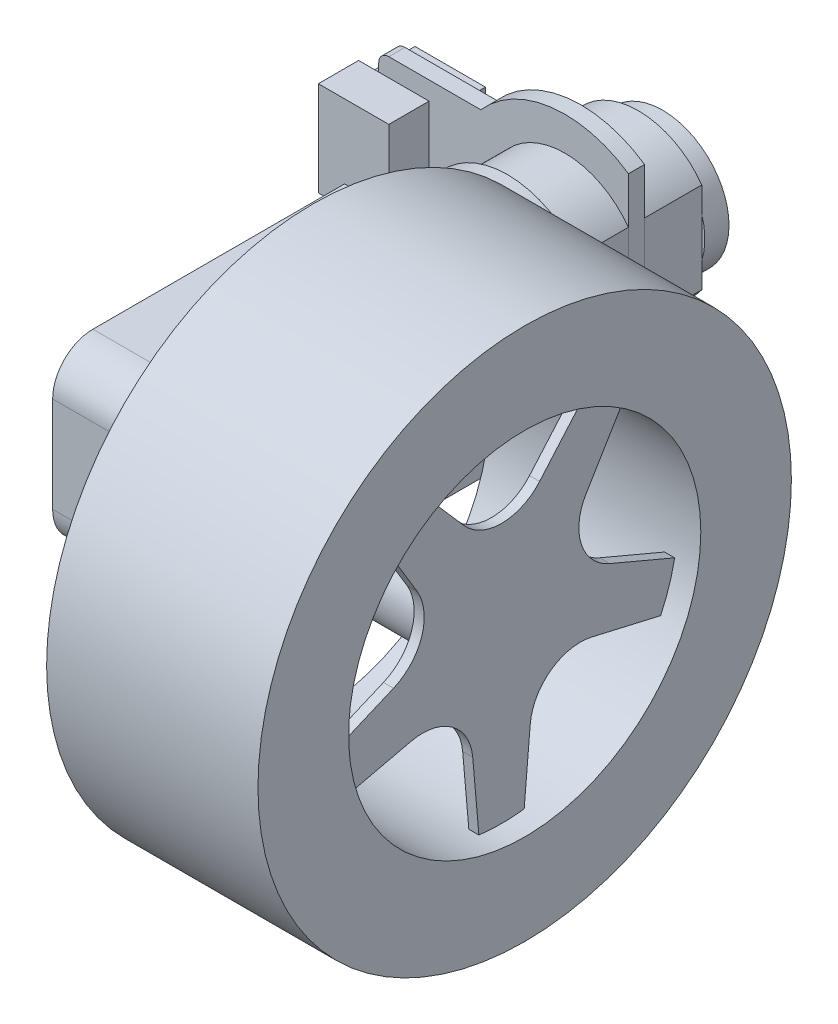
ISO-10303-21;
HEADER;
FILE_DESCRIPTION(('STEP AP214'),'2;1');
FILE_NAME('part.step','',(''),(''),'','','');
FILE_SCHEMA(('AUTOMOTIVE_DESIGN { 1 0 10303 214 1 1 1 1 }'));
ENDSEC;
DATA;
#1=APPLICATION_CONTEXT('core data for automotive mechanical design processes');
#2=APPLICATION_PROTOCOL_DEFINITION('international standard','automotive_design',2000,#1);
#3=PRODUCT_CONTEXT('',#1,'mechanical');
#4=PRODUCT('Part','Part','',(#3));
#5=PRODUCT_RELATED_PRODUCT_CATEGORY('part','',(#4));
#6=PRODUCT_DEFINITION_FORMATION('','',#4);
#7=PRODUCT_DEFINITION_CONTEXT('part definition',#1,'design');
#8=PRODUCT_DEFINITION('design','',#6,#7);
#9=PRODUCT_DEFINITION_SHAPE('','',#8);
#10=(LENGTH_UNIT() NAMED_UNIT(*) SI_UNIT(.MILLI.,.METRE.));
#11=(NAMED_UNIT(*) PLANE_ANGLE_UNIT() SI_UNIT($,.RADIAN.));
#12=(NAMED_UNIT(*) SI_UNIT($,.STERADIAN.) SOLID_ANGLE_UNIT());
#13=UNCERTAINTY_MEASURE_WITH_UNIT(LENGTH_MEASURE(1.E-05),#10,'distance_accuracy_value','');
#14=(GEOMETRIC_REPRESENTATION_CONTEXT(3) GLOBAL_UNCERTAINTY_ASSIGNED_CONTEXT((#13)) GLOBAL_UNIT_ASSIGNED_CONTEXT((#10,
#11,#12)) REPRESENTATION_CONTEXT('',''));
#15=CARTESIAN_POINT('',(0.,0.,0.));
#16=DIRECTION('',(0.,0.,1.));
#17=DIRECTION('',(1.,0.,0.));
#18=AXIS2_PLACEMENT_3D('',#15,#16,#17);
#19=CARTESIAN_POINT('',(-13.462,0.,-47.244));
#20=DIRECTION('',(0.,0.,-1.));
#21=DIRECTION('',(0.,1.,0.));
#22=AXIS2_PLACEMENT_3D('',#19,#20,#21);
#23=PLANE('',#22);
#24=CARTESIAN_POINT('',(-13.462,0.,-47.244));
#25=DIRECTION('',(0.,0.,-1.));
#26=DIRECTION('',(0.,1.,0.));
#27=AXIS2_PLACEMENT_3D('',#24,#25,#26);
#28=CIRCLE('',#27,9.8425);
#29=CARTESIAN_POINT('',(-5.461,-5.73226004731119,-47.244));
#30=VERTEX_POINT('',#29);
#31=CARTESIAN_POINT('',(-21.463,-5.7322600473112,-47.244));
#32=VERTEX_POINT('',#31);
#33=EDGE_CURVE('E539',#30,#32,#28,.T.);
#34=ORIENTED_EDGE('',*,*,#33,.F.);
#35=DIRECTION('',(0.,-1.,0.));
#36=VECTOR('',#35,1.);
#37=CARTESIAN_POINT('',(-5.461,5.73226004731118,-47.244));
#38=LINE('',#37,#36);
#39=CARTESIAN_POINT('',(-5.461,5.73226004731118,-47.244));
#40=VERTEX_POINT('',#39);
#41=EDGE_CURVE('E40',#40,#30,#38,.T.);
#42=ORIENTED_EDGE('',*,*,#41,.F.);
#43=CARTESIAN_POINT('',(-13.462,0.,-47.244));
#44=DIRECTION('',(0.,0.,-1.));
#45=DIRECTION('',(0.,1.,0.));
#46=AXIS2_PLACEMENT_3D('',#43,#44,#45);
#47=CIRCLE('',#46,9.8425);
#48=CARTESIAN_POINT('',(-21.463,5.73226004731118,-47.244));
#49=VERTEX_POINT('',#48);
#50=EDGE_CURVE('E519',#49,#40,#47,.T.);
#51=ORIENTED_EDGE('',*,*,#50,.F.);
#52=DIRECTION('',(0.,1.,0.));
#53=VECTOR('',#52,1.);
#54=CARTESIAN_POINT('',(-21.463,-5.73226004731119,-47.244));
#55=LINE('',#54,#53);
#56=EDGE_CURVE('E536',#32,#49,#55,.T.);
#57=ORIENTED_EDGE('',*,*,#56,.F.);
#58=EDGE_LOOP('',(#34,#42,#51,#57));
#59=FACE_BOUND('',#58,.T.);
#60=DIRECTION('',(0.,-1.,0.));
#61=VECTOR('',#60,1.);
#62=CARTESIAN_POINT('',(-30.607,-2.94484339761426,-47.244));
#63=LINE('',#62,#61);
#64=CARTESIAN_POINT('',(-30.607,4.92915660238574,-47.244));
#65=VERTEX_POINT('',#64);
#66=CARTESIAN_POINT('',(-30.607,-2.94484339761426,-47.244));
#67=VERTEX_POINT('',#66);
#68=EDGE_CURVE('E47',#65,#67,#63,.T.);
#69=ORIENTED_EDGE('',*,*,#68,.F.);
#70=DIRECTION('',(1.,0.,0.));
#71=VECTOR('',#70,1.);
#72=CARTESIAN_POINT('',(-39.497,4.92915660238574,-47.244));
#73=LINE('',#72,#71);
#74=CARTESIAN_POINT('',(-36.957,4.92915660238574,-47.244));
#75=VERTEX_POINT('',#74);
#76=EDGE_CURVE('E1739',#75,#65,#73,.T.);
#77=ORIENTED_EDGE('',*,*,#76,.F.);
#78=DIRECTION('',(0.,1.,0.));
#79=VECTOR('',#78,1.);
#80=CARTESIAN_POINT('',(-36.957,-8.001,-47.244));
#81=LINE('',#80,#79);
#82=CARTESIAN_POINT('',(-36.957,8.00099999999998,-47.244));
#83=VERTEX_POINT('',#82);
#84=EDGE_CURVE('E508',#75,#83,#81,.T.);
#85=ORIENTED_EDGE('',*,*,#84,.T.);
#86=CARTESIAN_POINT('',(-35.687,8.00099999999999,-47.244));
#87=DIRECTION('',(0.,0.,-1.));
#88=DIRECTION('',(0.,-1.,0.));
#89=AXIS2_PLACEMENT_3D('',#86,#87,#88);
#90=CIRCLE('',#89,1.27);
#91=CARTESIAN_POINT('',(-35.687,9.27099999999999,-47.244));
#92=VERTEX_POINT('',#91);
#93=EDGE_CURVE('E511',#83,#92,#90,.T.);
#94=ORIENTED_EDGE('',*,*,#93,.T.);
#95=DIRECTION('',(1.,0.,0.));
#96=VECTOR('',#95,1.);
#97=CARTESIAN_POINT('',(-24.0815088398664,9.27099999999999,-47.244));
#98=LINE('',#97,#96);
#99=CARTESIAN_POINT('',(-24.0815088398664,9.27099999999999,-47.244));
#100=VERTEX_POINT('',#99);
#101=EDGE_CURVE('E470',#92,#100,#98,.T.);
#102=ORIENTED_EDGE('',*,*,#101,.T.);
#103=CARTESIAN_POINT('',(-13.462,0.,-47.244));
#104=DIRECTION('',(0.,0.,-1.));
#105=DIRECTION('',(0.,1.,0.));
#106=AXIS2_PLACEMENT_3D('',#103,#104,#105);
#107=CIRCLE('',#106,14.097);
#108=CARTESIAN_POINT('',(-5.44687558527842,11.5966887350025,-47.244));
#109=VERTEX_POINT('',#108);
#110=EDGE_CURVE('E465',#100,#109,#107,.T.);
#111=ORIENTED_EDGE('',*,*,#110,.T.);
#112=DIRECTION('',(0.,-1.,0.));
#113=VECTOR('',#112,1.);
#114=CARTESIAN_POINT('',(-5.44687558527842,-11.5966887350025,-47.244));
#115=LINE('',#114,#113);
#116=CARTESIAN_POINT('',(-5.44687558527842,-11.5966887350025,-47.244));
#117=VERTEX_POINT('',#116);
#118=EDGE_CURVE('E496',#109,#117,#115,.T.);
#119=ORIENTED_EDGE('',*,*,#118,.T.);
#120=CARTESIAN_POINT('',(-13.462,0.,-47.244));
#121=DIRECTION('',(0.,0.,-1.));
#122=DIRECTION('',(0.,1.,0.));
#123=AXIS2_PLACEMENT_3D('',#120,#121,#122);
#124=CIRCLE('',#123,14.097);
#125=CARTESIAN_POINT('',(-24.0815088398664,-9.271,-47.244));
#126=VERTEX_POINT('',#125);
#127=EDGE_CURVE('E499',#117,#126,#124,.T.);
#128=ORIENTED_EDGE('',*,*,#127,.T.);
#129=DIRECTION('',(-1.,0.,0.));
#130=VECTOR('',#129,1.);
#131=CARTESIAN_POINT('',(-24.0815088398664,-9.271,-47.244));
#132=LINE('',#131,#130);
#133=CARTESIAN_POINT('',(-35.687,-9.27100000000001,-47.244));
#134=VERTEX_POINT('',#133);
#135=EDGE_CURVE('E502',#126,#134,#132,.T.);
#136=ORIENTED_EDGE('',*,*,#135,.T.);
#137=CARTESIAN_POINT('',(-35.687,-8.00100000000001,-47.244));
#138=DIRECTION('',(0.,0.,-1.));
#139=DIRECTION('',(0.,1.,0.));
#140=AXIS2_PLACEMENT_3D('',#137,#138,#139);
#141=CIRCLE('',#140,1.27);
#142=CARTESIAN_POINT('',(-36.957,-8.001,-47.244));
#143=VERTEX_POINT('',#142);
#144=EDGE_CURVE('E505',#134,#143,#141,.T.);
#145=ORIENTED_EDGE('',*,*,#144,.T.);
#146=CARTESIAN_POINT('',(-36.957,-2.94484339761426,-47.244));
#147=VERTEX_POINT('',#146);
#148=EDGE_CURVE('E509',#143,#147,#81,.T.);
#149=ORIENTED_EDGE('',*,*,#148,.T.);
#150=DIRECTION('',(-1.,0.,0.));
#151=VECTOR('',#150,1.);
#152=CARTESIAN_POINT('',(-39.497,-2.94484339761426,-47.244));
#153=LINE('',#152,#151);
#154=EDGE_CURVE('E52',#67,#147,#153,.T.);
#155=ORIENTED_EDGE('',*,*,#154,.F.);
#156=EDGE_LOOP('',(#69,#77,#85,#94,#102,#111,#119,#128,#136,#145,#149,#155));
#157=FACE_BOUND('',#156,.T.);
#158=ADVANCED_FACE('F32',(#59,#157),#23,.T.);
#159=CARTESIAN_POINT('',(-13.462,0.,-45.212));
#160=DIRECTION('',(0.,0.,-1.));
#161=DIRECTION('',(0.,1.,0.));
#162=AXIS2_PLACEMENT_3D('',#159,#160,#161);
#163=PLANE('',#162);
#164=DIRECTION('',(0.,-1.,0.));
#165=VECTOR('',#164,1.);
#166=CARTESIAN_POINT('',(-5.461,5.73226004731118,-45.212));
#167=LINE('',#166,#165);
#168=CARTESIAN_POINT('',(-5.461,5.73226004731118,-45.212));
#169=VERTEX_POINT('',#168);
#170=CARTESIAN_POINT('',(-5.461,-5.73226004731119,-45.212));
#171=VERTEX_POINT('',#170);
#172=EDGE_CURVE('E11',#169,#171,#167,.T.);
#173=ORIENTED_EDGE('',*,*,#172,.T.);
#174=CARTESIAN_POINT('',(-13.462,0.,-45.212));
#175=DIRECTION('',(0.,0.,-1.));
#176=DIRECTION('',(0.,1.,0.));
#177=AXIS2_PLACEMENT_3D('',#174,#175,#176);
#178=CIRCLE('',#177,9.8425);
#179=CARTESIAN_POINT('',(-21.463,-5.73226004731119,-45.212));
#180=VERTEX_POINT('',#179);
#181=EDGE_CURVE('E548',#171,#180,#178,.T.);
#182=ORIENTED_EDGE('',*,*,#181,.T.);
#183=DIRECTION('',(0.,1.,0.));
#184=VECTOR('',#183,1.);
#185=CARTESIAN_POINT('',(-21.463,-5.73226004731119,-45.212));
#186=LINE('',#185,#184);
#187=CARTESIAN_POINT('',(-21.463,5.73226004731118,-45.212));
#188=VERTEX_POINT('',#187);
#189=EDGE_CURVE('E545',#180,#188,#186,.T.);
#190=ORIENTED_EDGE('',*,*,#189,.T.);
#191=CARTESIAN_POINT('',(-13.462,0.,-45.212));
#192=DIRECTION('',(0.,0.,-1.));
#193=DIRECTION('',(0.,1.,0.));
#194=AXIS2_PLACEMENT_3D('',#191,#192,#193);
#195=CIRCLE('',#194,9.8425);
#196=EDGE_CURVE('E542',#188,#169,#195,.T.);
#197=ORIENTED_EDGE('',*,*,#196,.T.);
#198=EDGE_LOOP('',(#173,#182,#190,#197));
#199=FACE_BOUND('',#198,.T.);
#200=DIRECTION('',(-1.,0.,0.));
#201=VECTOR('',#200,1.);
#202=CARTESIAN_POINT('',(-30.607,6.95147746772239,-45.212));
#203=LINE('',#202,#201);
#204=CARTESIAN_POINT('',(-30.607,6.95147746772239,-45.212));
#205=VERTEX_POINT('',#204);
#206=CARTESIAN_POINT('',(-36.957,6.95147746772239,-45.212));
#207=VERTEX_POINT('',#206);
#208=EDGE_CURVE('E448',#205,#207,#203,.T.);
#209=ORIENTED_EDGE('',*,*,#208,.F.);
#210=DIRECTION('',(0.,1.,0.));
#211=VECTOR('',#210,1.);
#212=CARTESIAN_POINT('',(-30.607,-4.98652253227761,-45.212));
#213=LINE('',#212,#211);
#214=CARTESIAN_POINT('',(-30.607,-4.98652253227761,-45.212));
#215=VERTEX_POINT('',#214);
#216=EDGE_CURVE('E428',#215,#205,#213,.T.);
#217=ORIENTED_EDGE('',*,*,#216,.F.);
#218=DIRECTION('',(1.,0.,0.));
#219=VECTOR('',#218,1.);
#220=CARTESIAN_POINT('',(-30.607,-4.98652253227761,-45.212));
#221=LINE('',#220,#219);
#222=CARTESIAN_POINT('',(-36.957,-4.98652253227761,-45.212));
#223=VERTEX_POINT('',#222);
#224=EDGE_CURVE('E452',#223,#215,#221,.T.);
#225=ORIENTED_EDGE('',*,*,#224,.F.);
#226=DIRECTION('',(0.,1.,0.));
#227=VECTOR('',#226,1.);
#228=CARTESIAN_POINT('',(-36.957,-8.001,-45.212));
#229=LINE('',#228,#227);
#230=CARTESIAN_POINT('',(-36.957,-8.001,-45.212));
#231=VERTEX_POINT('',#230);
#232=EDGE_CURVE('E483',#231,#223,#229,.T.);
#233=ORIENTED_EDGE('',*,*,#232,.F.);
#234=CARTESIAN_POINT('',(-35.687,-8.00100000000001,-45.212));
#235=DIRECTION('',(0.,0.,-1.));
#236=DIRECTION('',(0.,1.,0.));
#237=AXIS2_PLACEMENT_3D('',#234,#235,#236);
#238=CIRCLE('',#237,1.27);
#239=CARTESIAN_POINT('',(-35.687,-9.27100000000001,-45.212));
#240=VERTEX_POINT('',#239);
#241=EDGE_CURVE('E479',#240,#231,#238,.T.);
#242=ORIENTED_EDGE('',*,*,#241,.F.);
#243=DIRECTION('',(-1.,0.,0.));
#244=VECTOR('',#243,1.);
#245=CARTESIAN_POINT('',(-24.0815088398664,-9.271,-45.212));
#246=LINE('',#245,#244);
#247=CARTESIAN_POINT('',(-24.0815088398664,-9.271,-45.212));
#248=VERTEX_POINT('',#247);
#249=EDGE_CURVE('E476',#248,#240,#246,.T.);
#250=ORIENTED_EDGE('',*,*,#249,.F.);
#251=CARTESIAN_POINT('',(-13.462,0.,-45.212));
#252=DIRECTION('',(0.,0.,-1.));
#253=DIRECTION('',(0.,1.,0.));
#254=AXIS2_PLACEMENT_3D('',#251,#252,#253);
#255=CIRCLE('',#254,14.097);
#256=CARTESIAN_POINT('',(-5.44687558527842,-11.5966887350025,-45.212));
#257=VERTEX_POINT('',#256);
#258=EDGE_CURVE('E473',#257,#248,#255,.T.);
#259=ORIENTED_EDGE('',*,*,#258,.F.);
#260=DIRECTION('',(0.,-1.,0.));
#261=VECTOR('',#260,1.);
#262=CARTESIAN_POINT('',(-5.44687558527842,-11.5966887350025,-45.212));
#263=LINE('',#262,#261);
#264=CARTESIAN_POINT('',(-5.44687558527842,11.5966887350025,-45.212));
#265=VERTEX_POINT('',#264);
#266=EDGE_CURVE('E469',#265,#257,#263,.T.);
#267=ORIENTED_EDGE('',*,*,#266,.F.);
#268=CARTESIAN_POINT('',(-13.462,0.,-45.212));
#269=DIRECTION('',(0.,0.,-1.));
#270=DIRECTION('',(0.,1.,0.));
#271=AXIS2_PLACEMENT_3D('',#268,#269,#270);
#272=CIRCLE('',#271,14.097);
#273=CARTESIAN_POINT('',(-24.0815088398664,9.27099999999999,-45.212));
#274=VERTEX_POINT('',#273);
#275=EDGE_CURVE('E466',#274,#265,#272,.T.);
#276=ORIENTED_EDGE('',*,*,#275,.F.);
#277=DIRECTION('',(1.,0.,0.));
#278=VECTOR('',#277,1.);
#279=CARTESIAN_POINT('',(-24.0815088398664,9.27099999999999,-45.212));
#280=LINE('',#279,#278);
#281=CARTESIAN_POINT('',(-35.687,9.27099999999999,-45.212));
#282=VERTEX_POINT('',#281);
#283=EDGE_CURVE('E490',#282,#274,#280,.T.);
#284=ORIENTED_EDGE('',*,*,#283,.F.);
#285=CARTESIAN_POINT('',(-35.687,8.00099999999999,-45.212));
#286=DIRECTION('',(0.,0.,-1.));
#287=DIRECTION('',(0.,-1.,0.));
#288=AXIS2_PLACEMENT_3D('',#285,#286,#287);
#289=CIRCLE('',#288,1.27);
#290=CARTESIAN_POINT('',(-36.957,8.00099999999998,-45.212));
#291=VERTEX_POINT('',#290);
#292=EDGE_CURVE('E486',#291,#282,#289,.T.);
#293=ORIENTED_EDGE('',*,*,#292,.F.);
#294=EDGE_CURVE('E482',#207,#291,#229,.T.);
#295=ORIENTED_EDGE('',*,*,#294,.F.);
#296=EDGE_LOOP('',(#209,#217,#225,#233,#242,#250,#259,#267,#276,#284,#293,#295));
#297=FACE_BOUND('',#296,.T.);
#298=ADVANCED_FACE('F889',(#199,#297),#163,.F.);
#299=CARTESIAN_POINT('',(-13.462,0.,-54.483));
#300=DIRECTION('',(0.,0.,1.));
#301=DIRECTION('',(0.,-1.,0.));
#302=AXIS2_PLACEMENT_3D('',#299,#300,#301);
#303=CYLINDRICAL_SURFACE('',#302,9.8425);
#304=ORIENTED_EDGE('',*,*,#181,.F.);
#305=DIRECTION('',(0.,0.,1.));
#306=VECTOR('',#305,1.);
#307=CARTESIAN_POINT('',(-5.461,-5.73226004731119,-54.483));
#308=LINE('',#307,#306);
#309=CARTESIAN_POINT('',(-5.461,-5.73226004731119,-37.973));
#310=VERTEX_POINT('',#309);
#311=EDGE_CURVE('E574',#171,#310,#308,.T.);
#312=ORIENTED_EDGE('',*,*,#311,.T.);
#313=CARTESIAN_POINT('',(-13.462,0.,-37.973));
#314=DIRECTION('',(0.,0.,-1.));
#315=DIRECTION('',(0.,1.,0.));
#316=AXIS2_PLACEMENT_3D('',#313,#314,#315);
#317=CIRCLE('',#316,9.8425);
#318=CARTESIAN_POINT('',(-21.463,-5.73226004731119,-37.973));
#319=VERTEX_POINT('',#318);
#320=EDGE_CURVE('E555',#310,#319,#317,.T.);
#321=ORIENTED_EDGE('',*,*,#320,.T.);
#322=DIRECTION('',(0.,0.,1.));
#323=VECTOR('',#322,1.);
#324=CARTESIAN_POINT('',(-21.463,-5.7322600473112,-54.483));
#325=LINE('',#324,#323);
#326=EDGE_CURVE('E597',#180,#319,#325,.T.);
#327=ORIENTED_EDGE('',*,*,#326,.F.);
#328=EDGE_LOOP('',(#304,#312,#321,#327));
#329=FACE_BOUND('',#328,.T.);
#330=ADVANCED_FACE('F894',(#329),#303,.T.);
#331=CARTESIAN_POINT('',(-21.463,-5.7322600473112,-54.483));
#332=DIRECTION('',(1.,0.,0.));
#333=DIRECTION('',(0.,0.,-1.));
#334=AXIS2_PLACEMENT_3D('',#331,#332,#333);
#335=PLANE('',#334);
#336=ORIENTED_EDGE('',*,*,#189,.F.);
#337=ORIENTED_EDGE('',*,*,#326,.T.);
#338=DIRECTION('',(0.,1.,0.));
#339=VECTOR('',#338,1.);
#340=CARTESIAN_POINT('',(-21.463,-5.73226004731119,-37.973));
#341=LINE('',#340,#339);
#342=CARTESIAN_POINT('',(-21.463,5.73226004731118,-37.973));
#343=VERTEX_POINT('',#342);
#344=EDGE_CURVE('E578',#319,#343,#341,.T.);
#345=ORIENTED_EDGE('',*,*,#344,.T.);
#346=DIRECTION('',(0.,0.,1.));
#347=VECTOR('',#346,1.);
#348=CARTESIAN_POINT('',(-21.463,5.73226004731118,-54.483));
#349=LINE('',#348,#347);
#350=EDGE_CURVE('E593',#188,#343,#349,.T.);
#351=ORIENTED_EDGE('',*,*,#350,.F.);
#352=EDGE_LOOP('',(#336,#337,#345,#351));
#353=FACE_BOUND('',#352,.T.);
#354=ADVANCED_FACE('F952',(#353),#335,.F.);
#355=CARTESIAN_POINT('',(-13.462,0.,-54.483));
#356=DIRECTION('',(0.,0.,1.));
#357=DIRECTION('',(0.,-1.,0.));
#358=AXIS2_PLACEMENT_3D('',#355,#356,#357);
#359=CYLINDRICAL_SURFACE('',#358,9.8425);
#360=ORIENTED_EDGE('',*,*,#196,.F.);
#361=ORIENTED_EDGE('',*,*,#350,.T.);
#362=CARTESIAN_POINT('',(-13.462,0.,-37.973));
#363=DIRECTION('',(0.,0.,-1.));
#364=DIRECTION('',(0.,1.,0.));
#365=AXIS2_PLACEMENT_3D('',#362,#363,#364);
#366=CIRCLE('',#365,9.8425);
#367=CARTESIAN_POINT('',(-5.461,5.73226004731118,-37.973));
#368=VERTEX_POINT('',#367);
#369=EDGE_CURVE('E581',#343,#368,#366,.T.);
#370=ORIENTED_EDGE('',*,*,#369,.T.);
#371=DIRECTION('',(0.,0.,1.));
#372=VECTOR('',#371,1.);
#373=CARTESIAN_POINT('',(-5.461,5.73226004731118,-54.483));
#374=LINE('',#373,#372);
#375=EDGE_CURVE('E589',#169,#368,#374,.T.);
#376=ORIENTED_EDGE('',*,*,#375,.F.);
#377=EDGE_LOOP('',(#360,#361,#370,#376));
#378=FACE_BOUND('',#377,.T.);
#379=ADVANCED_FACE('F949',(#378),#359,.T.);
#380=CARTESIAN_POINT('',(-5.461,5.73226004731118,-54.483));
#381=DIRECTION('',(-1.,0.,0.));
#382=DIRECTION('',(0.,0.,1.));
#383=AXIS2_PLACEMENT_3D('',#380,#381,#382);
#384=PLANE('',#383);
#385=ORIENTED_EDGE('',*,*,#172,.F.);
#386=ORIENTED_EDGE('',*,*,#375,.T.);
#387=DIRECTION('',(0.,-1.,0.));
#388=VECTOR('',#387,1.);
#389=CARTESIAN_POINT('',(-5.461,5.73226004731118,-37.973));
#390=LINE('',#389,#388);
#391=EDGE_CURVE('E564',#368,#310,#390,.T.);
#392=ORIENTED_EDGE('',*,*,#391,.T.);
#393=ORIENTED_EDGE('',*,*,#311,.F.);
#394=EDGE_LOOP('',(#385,#386,#392,#393));
#395=FACE_BOUND('',#394,.T.);
#396=ADVANCED_FACE('F946',(#395),#384,.F.);
#397=CARTESIAN_POINT('',(-13.462,0.,-37.973));
#398=DIRECTION('',(0.,0.,-1.));
#399=DIRECTION('',(0.,1.,0.));
#400=AXIS2_PLACEMENT_3D('',#397,#398,#399);
#401=PLANE('',#400);
#402=CARTESIAN_POINT('',(-13.462,0.,-37.973));
#403=DIRECTION('',(0.,0.,-1.));
#404=DIRECTION('',(0.,1.,0.));
#405=AXIS2_PLACEMENT_3D('',#402,#403,#404);
#406=CIRCLE('',#405,11.1125);
#407=CARTESIAN_POINT('',(-4.191,-6.12668060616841,-37.973));
#408=VERTEX_POINT('',#407);
#409=CARTESIAN_POINT('',(-22.733,-6.12668060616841,-37.973));
#410=VERTEX_POINT('',#409);
#411=EDGE_CURVE('E602',#408,#410,#406,.T.);
#412=ORIENTED_EDGE('',*,*,#411,.T.);
#413=DIRECTION('',(0.,1.,0.));
#414=VECTOR('',#413,1.);
#415=CARTESIAN_POINT('',(-22.733,6.12668060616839,-37.973));
#416=LINE('',#415,#414);
#417=CARTESIAN_POINT('',(-22.733,6.12668060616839,-37.973));
#418=VERTEX_POINT('',#417);
#419=EDGE_CURVE('E605',#410,#418,#416,.T.);
#420=ORIENTED_EDGE('',*,*,#419,.T.);
#421=CARTESIAN_POINT('',(-13.462,0.,-37.973));
#422=DIRECTION('',(0.,0.,-1.));
#423=DIRECTION('',(0.,1.,0.));
#424=AXIS2_PLACEMENT_3D('',#421,#422,#423);
#425=CIRCLE('',#424,11.1125);
#426=CARTESIAN_POINT('',(-4.191,6.12668060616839,-37.973));
#427=VERTEX_POINT('',#426);
#428=EDGE_CURVE('E608',#418,#427,#425,.T.);
#429=ORIENTED_EDGE('',*,*,#428,.T.);
#430=DIRECTION('',(0.,-1.,0.));
#431=VECTOR('',#430,1.);
#432=CARTESIAN_POINT('',(-4.191,-6.12668060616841,-37.973));
#433=LINE('',#432,#431);
#434=EDGE_CURVE('E610',#427,#408,#433,.T.);
#435=ORIENTED_EDGE('',*,*,#434,.T.);
#436=EDGE_LOOP('',(#412,#420,#429,#435));
#437=FACE_BOUND('',#436,.T.);
#438=ORIENTED_EDGE('',*,*,#344,.F.);
#439=ORIENTED_EDGE('',*,*,#320,.F.);
#440=ORIENTED_EDGE('',*,*,#391,.F.);
#441=ORIENTED_EDGE('',*,*,#369,.F.);
#442=EDGE_LOOP('',(#438,#439,#440,#441));
#443=FACE_BOUND('',#442,.T.);
#444=ADVANCED_FACE('F956',(#437,#443),#401,.T.);
#445=CARTESIAN_POINT('',(-22.733,11.1125,-26.67));
#446=DIRECTION('',(0.,0.,1.));
#447=DIRECTION('',(0.,-1.,0.));
#448=AXIS2_PLACEMENT_3D('',#445,#446,#447);
#449=PLANE('',#448);
#450=CARTESIAN_POINT('',(-13.462,0.,-26.67));
#451=DIRECTION('',(0.,0.,-1.));
#452=DIRECTION('',(0.,1.,0.));
#453=AXIS2_PLACEMENT_3D('',#450,#451,#452);
#454=CIRCLE('',#453,11.1125);
#455=CARTESIAN_POINT('',(-4.191,-6.1266806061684,-26.67));
#456=VERTEX_POINT('',#455);
#457=CARTESIAN_POINT('',(-13.462,-11.1125,-26.67));
#458=VERTEX_POINT('',#457);
#459=EDGE_CURVE('E601',#456,#458,#454,.T.);
#460=ORIENTED_EDGE('',*,*,#459,.F.);
#461=DIRECTION('',(0.,-1.,0.));
#462=VECTOR('',#461,1.);
#463=CARTESIAN_POINT('',(-4.191,11.1125,-26.67));
#464=LINE('',#463,#462);
#465=CARTESIAN_POINT('',(-4.191,-11.1125,-26.67));
#466=VERTEX_POINT('',#465);
#467=EDGE_CURVE('E640',#456,#466,#464,.T.);
#468=ORIENTED_EDGE('',*,*,#467,.T.);
#469=DIRECTION('',(1.,0.,0.));
#470=VECTOR('',#469,1.);
#471=CARTESIAN_POINT('',(-22.733,-11.1125,-26.67));
#472=LINE('',#471,#470);
#473=EDGE_CURVE('E686',#458,#466,#472,.T.);
#474=ORIENTED_EDGE('',*,*,#473,.F.);
#475=EDGE_LOOP('',(#460,#468,#474));
#476=FACE_BOUND('',#475,.T.);
#477=ADVANCED_FACE('F959',(#476),#449,.F.);
#478=CARTESIAN_POINT('',(-22.733,-6.1266806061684,-26.67));
#479=VERTEX_POINT('',#478);
#480=EDGE_CURVE('E615',#458,#479,#454,.T.);
#481=ORIENTED_EDGE('',*,*,#480,.F.);
#482=CARTESIAN_POINT('',(-22.733,-11.1125,-26.67));
#483=VERTEX_POINT('',#482);
#484=EDGE_CURVE('E687',#483,#458,#472,.T.);
#485=ORIENTED_EDGE('',*,*,#484,.F.);
#486=DIRECTION('',(0.,-1.,0.));
#487=VECTOR('',#486,1.);
#488=CARTESIAN_POINT('',(-22.733,11.1125,-26.67));
#489=LINE('',#488,#487);
#490=EDGE_CURVE('E647',#479,#483,#489,.T.);
#491=ORIENTED_EDGE('',*,*,#490,.F.);
#492=EDGE_LOOP('',(#481,#485,#491));
#493=FACE_BOUND('',#492,.T.);
#494=ADVANCED_FACE('F1517',(#493),#449,.F.);
#495=CARTESIAN_POINT('',(-13.462,0.,-26.67));
#496=DIRECTION('',(0.,0.,-1.));
#497=DIRECTION('',(0.,1.,0.));
#498=AXIS2_PLACEMENT_3D('',#495,#496,#497);
#499=CIRCLE('',#498,11.1125);
#500=CARTESIAN_POINT('',(-22.733,6.1266806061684,-26.67));
#501=VERTEX_POINT('',#500);
#502=CARTESIAN_POINT('',(-13.462,11.1125,-26.67));
#503=VERTEX_POINT('',#502);
#504=EDGE_CURVE('E606',#501,#503,#499,.T.);
#505=ORIENTED_EDGE('',*,*,#504,.F.);
#506=CARTESIAN_POINT('',(-22.733,11.1125,-26.67));
#507=VERTEX_POINT('',#506);
#508=EDGE_CURVE('E643',#507,#501,#489,.T.);
#509=ORIENTED_EDGE('',*,*,#508,.F.);
#510=DIRECTION('',(1.,0.,0.));
#511=VECTOR('',#510,1.);
#512=CARTESIAN_POINT('',(-22.733,11.1125,-26.67));
#513=LINE('',#512,#511);
#514=EDGE_CURVE('E671',#507,#503,#513,.T.);
#515=ORIENTED_EDGE('',*,*,#514,.T.);
#516=EDGE_LOOP('',(#505,#509,#515));
#517=FACE_BOUND('',#516,.T.);
#518=ADVANCED_FACE('F1009',(#517),#449,.F.);
#519=CARTESIAN_POINT('',(26.67,0.,0.));
#520=DIRECTION('',(1.,0.,0.));
#521=DIRECTION('',(0.,0.,-1.));
#522=AXIS2_PLACEMENT_3D('',#519,#520,#521);
#523=PLANE('',#522);
#524=CARTESIAN_POINT('',(26.67,0.,0.));
#525=DIRECTION('',(1.,0.,0.));
#526=DIRECTION('',(0.,0.,-1.));
#527=AXIS2_PLACEMENT_3D('',#524,#525,#526);
#528=CIRCLE('',#527,33.655);
#529=CARTESIAN_POINT('',(26.67,0.,-33.655));
#530=VERTEX_POINT('',#529);
#531=EDGE_CURVE('E838',#530,#530,#528,.T.);
#532=ORIENTED_EDGE('',*,*,#531,.T.);
#533=EDGE_LOOP('',(#532));
#534=FACE_BOUND('',#533,.T.);
#535=CARTESIAN_POINT('',(26.67,0.,0.));
#536=DIRECTION('',(1.,0.,0.));
#537=DIRECTION('',(0.,0.,-1.));
#538=AXIS2_PLACEMENT_3D('',#535,#536,#537);
#539=CIRCLE('',#538,22.225);
#540=CARTESIAN_POINT('',(26.67,0.,-22.225));
#541=VERTEX_POINT('',#540);
#542=EDGE_CURVE('E832',#541,#541,#539,.T.);
#543=ORIENTED_EDGE('',*,*,#542,.F.);
#544=EDGE_LOOP('',(#543));
#545=FACE_BOUND('',#544,.T.);
#546=ADVANCED_FACE('F1085',(#534,#545),#523,.T.);
#547=CARTESIAN_POINT('',(0.,0.,0.));
#548=DIRECTION('',(1.,0.,0.));
#549=DIRECTION('',(0.,0.,-1.));
#550=AXIS2_PLACEMENT_3D('',#547,#548,#549);
#551=PLANE('',#550);
#552=CARTESIAN_POINT('',(0.,0.,0.));
#553=DIRECTION('',(1.,0.,0.));
#554=DIRECTION('',(0.,0.,-1.));
#555=AXIS2_PLACEMENT_3D('',#552,#553,#554);
#556=CIRCLE('',#555,33.655);
#557=CARTESIAN_POINT('',(0.,0.,-33.655));
#558=VERTEX_POINT('',#557);
#559=EDGE_CURVE('E835',#558,#558,#556,.T.);
#560=ORIENTED_EDGE('',*,*,#559,.F.);
#561=EDGE_LOOP('',(#560));
#562=FACE_BOUND('',#561,.T.);
#563=CARTESIAN_POINT('',(0.,0.,0.));
#564=DIRECTION('',(1.,0.,0.));
#565=DIRECTION('',(0.,0.,-1.));
#566=AXIS2_PLACEMENT_3D('',#563,#564,#565);
#567=CIRCLE('',#566,22.225);
#568=CARTESIAN_POINT('',(0.,0.,-22.225));
#569=VERTEX_POINT('',#568);
#570=EDGE_CURVE('E785',#569,#569,#567,.T.);
#571=ORIENTED_EDGE('',*,*,#570,.T.);
#572=EDGE_LOOP('',(#571));
#573=FACE_BOUND('',#572,.T.);
#574=ADVANCED_FACE('F1087',(#562,#573),#551,.F.);
#575=CARTESIAN_POINT('',(26.67,0.,0.));
#576=DIRECTION('',(-1.,0.,0.));
#577=DIRECTION('',(0.,0.,1.));
#578=AXIS2_PLACEMENT_3D('',#575,#576,#577);
#579=CYLINDRICAL_SURFACE('',#578,33.655);
#580=ORIENTED_EDGE('',*,*,#531,.F.);
#581=EDGE_LOOP('',(#580));
#582=FACE_BOUND('',#581,.T.);
#583=ORIENTED_EDGE('',*,*,#559,.T.);
#584=EDGE_LOOP('',(#583));
#585=FACE_BOUND('',#584,.T.);
#586=ADVANCED_FACE('F34',(#582,#585),#579,.T.);
#587=CARTESIAN_POINT('',(26.67,0.,0.));
#588=DIRECTION('',(-1.,0.,0.));
#589=DIRECTION('',(0.,0.,1.));
#590=AXIS2_PLACEMENT_3D('',#587,#588,#589);
#591=CYLINDRICAL_SURFACE('',#590,22.225);
#592=CARTESIAN_POINT('',(22.479,0.,0.));
#593=DIRECTION('',(-1.,0.,0.));
#594=DIRECTION('',(0.,0.,1.));
#595=AXIS2_PLACEMENT_3D('',#592,#593,#594);
#596=CIRCLE('',#595,22.225);
#597=CARTESIAN_POINT('',(22.479,16.1515735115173,15.2668692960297));
#598=VERTEX_POINT('',#597);
#599=CARTESIAN_POINT('',(22.479,19.5107662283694,10.6433371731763));
#600=VERTEX_POINT('',#599);
#601=EDGE_CURVE('E850',#598,#600,#596,.T.);
#602=ORIENTED_EDGE('',*,*,#601,.F.);
#603=DIRECTION('',(1.,0.,0.));
#604=VECTOR('',#603,1.);
#605=CARTESIAN_POINT('',(22.479,16.1515735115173,15.2668692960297));
#606=LINE('',#605,#604);
#607=CARTESIAN_POINT('',(23.749,16.1515735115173,15.2668692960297));
#608=VERTEX_POINT('',#607);
#609=EDGE_CURVE('E790',#598,#608,#606,.T.);
#610=ORIENTED_EDGE('',*,*,#609,.T.);
#611=CARTESIAN_POINT('',(23.749,0.,0.));
#612=DIRECTION('',(-1.,0.,0.));
#613=DIRECTION('',(0.,0.,1.));
#614=AXIS2_PLACEMENT_3D('',#611,#612,#613);
#615=CIRCLE('',#614,22.225);
#616=CARTESIAN_POINT('',(23.749,19.5107662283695,10.6433371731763));
#617=VERTEX_POINT('',#616);
#618=EDGE_CURVE('E847',#608,#617,#615,.T.);
#619=ORIENTED_EDGE('',*,*,#618,.T.);
#620=DIRECTION('',(1.,0.,0.));
#621=VECTOR('',#620,1.);
#622=CARTESIAN_POINT('',(22.479,19.5107662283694,10.6433371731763));
#623=LINE('',#622,#621);
#624=EDGE_CURVE('E793',#600,#617,#623,.T.);
#625=ORIENTED_EDGE('',*,*,#624,.F.);
#626=EDGE_LOOP('',(#602,#610,#619,#625));
#627=FACE_BOUND('',#626,.T.);
#628=CARTESIAN_POINT('',(22.479,19.5107662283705,-10.6433371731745));
#629=VERTEX_POINT('',#628);
#630=CARTESIAN_POINT('',(22.479,16.1515735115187,-15.2668692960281));
#631=VERTEX_POINT('',#630);
#632=EDGE_CURVE('E1624',#629,#631,#596,.T.);
#633=ORIENTED_EDGE('',*,*,#632,.F.);
#634=DIRECTION('',(1.,0.,0.));
#635=VECTOR('',#634,1.);
#636=CARTESIAN_POINT('',(22.479,19.5107662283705,-10.6433371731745));
#637=LINE('',#636,#635);
#638=CARTESIAN_POINT('',(23.749,19.5107662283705,-10.6433371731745));
#639=VERTEX_POINT('',#638);
#640=EDGE_CURVE('E800',#629,#639,#637,.T.);
#641=ORIENTED_EDGE('',*,*,#640,.T.);
#642=CARTESIAN_POINT('',(23.749,16.1515735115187,-15.2668692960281));
#643=VERTEX_POINT('',#642);
#644=EDGE_CURVE('E1649',#639,#643,#615,.T.);
#645=ORIENTED_EDGE('',*,*,#644,.T.);
#646=DIRECTION('',(1.,0.,0.));
#647=VECTOR('',#646,1.);
#648=CARTESIAN_POINT('',(22.479,16.1515735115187,-15.2668692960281));
#649=LINE('',#648,#647);
#650=EDGE_CURVE('E803',#631,#643,#649,.T.);
#651=ORIENTED_EDGE('',*,*,#650,.F.);
#652=EDGE_LOOP('',(#633,#641,#645,#651));
#653=FACE_BOUND('',#652,.T.);
#654=CARTESIAN_POINT('',(22.479,-4.09325683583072,-21.8448134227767));
#655=VERTEX_POINT('',#654);
#656=CARTESIAN_POINT('',(22.479,-9.52854482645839,-20.0787812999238));
#657=VERTEX_POINT('',#656);
#658=EDGE_CURVE('E1629',#655,#657,#596,.T.);
#659=ORIENTED_EDGE('',*,*,#658,.F.);
#660=DIRECTION('',(1.,0.,0.));
#661=VECTOR('',#660,1.);
#662=CARTESIAN_POINT('',(22.479,-4.09325683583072,-21.8448134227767));
#663=LINE('',#662,#661);
#664=CARTESIAN_POINT('',(23.749,-4.09325683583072,-21.8448134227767));
#665=VERTEX_POINT('',#664);
#666=EDGE_CURVE('E810',#655,#665,#663,.T.);
#667=ORIENTED_EDGE('',*,*,#666,.T.);
#668=CARTESIAN_POINT('',(23.749,-9.52854482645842,-20.0787812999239));
#669=VERTEX_POINT('',#668);
#670=EDGE_CURVE('E1647',#665,#669,#615,.T.);
#671=ORIENTED_EDGE('',*,*,#670,.T.);
#672=DIRECTION('',(1.,0.,0.));
#673=VECTOR('',#672,1.);
#674=CARTESIAN_POINT('',(22.479,-9.52854482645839,-20.0787812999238));
#675=LINE('',#674,#673);
#676=EDGE_CURVE('E813',#657,#669,#675,.T.);
#677=ORIENTED_EDGE('',*,*,#676,.F.);
#678=EDGE_LOOP('',(#659,#667,#671,#677));
#679=FACE_BOUND('',#678,.T.);
#680=CARTESIAN_POINT('',(22.479,-22.0405380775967,-2.85750000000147));
#681=VERTEX_POINT('',#680);
#682=CARTESIAN_POINT('',(22.479,-22.0405380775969,2.85749999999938));
#683=VERTEX_POINT('',#682);
#684=EDGE_CURVE('E849',#681,#683,#596,.T.);
#685=ORIENTED_EDGE('',*,*,#684,.F.);
#686=DIRECTION('',(1.,0.,0.));
#687=VECTOR('',#686,1.);
#688=CARTESIAN_POINT('',(22.479,-22.0405380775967,-2.85750000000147));
#689=LINE('',#688,#687);
#690=CARTESIAN_POINT('',(23.749,-22.0405380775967,-2.85750000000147));
#691=VERTEX_POINT('',#690);
#692=EDGE_CURVE('E820',#681,#691,#689,.T.);
#693=ORIENTED_EDGE('',*,*,#692,.T.);
#694=CARTESIAN_POINT('',(23.749,-22.040538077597,2.85749999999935));
#695=VERTEX_POINT('',#694);
#696=EDGE_CURVE('E846',#691,#695,#615,.T.);
#697=ORIENTED_EDGE('',*,*,#696,.T.);
#698=DIRECTION('',(1.,0.,0.));
#699=VECTOR('',#698,1.);
#700=CARTESIAN_POINT('',(22.479,-22.0405380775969,2.85749999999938));
#701=LINE('',#700,#699);
#702=EDGE_CURVE('E823',#683,#695,#701,.T.);
#703=ORIENTED_EDGE('',*,*,#702,.F.);
#704=EDGE_LOOP('',(#685,#693,#697,#703));
#705=FACE_BOUND('',#704,.T.);
#706=CARTESIAN_POINT('',(22.479,-9.52854482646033,20.078781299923));
#707=VERTEX_POINT('',#706);
#708=CARTESIAN_POINT('',(22.479,-4.09325683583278,21.8448134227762));
#709=VERTEX_POINT('',#708);
#710=EDGE_CURVE('E848',#707,#709,#596,.T.);
#711=ORIENTED_EDGE('',*,*,#710,.F.);
#712=DIRECTION('',(1.,0.,0.));
#713=VECTOR('',#712,1.);
#714=CARTESIAN_POINT('',(22.479,-9.52854482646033,20.078781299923));
#715=LINE('',#714,#713);
#716=CARTESIAN_POINT('',(23.749,-9.52854482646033,20.078781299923));
#717=VERTEX_POINT('',#716);
#718=EDGE_CURVE('E743',#707,#717,#715,.T.);
#719=ORIENTED_EDGE('',*,*,#718,.T.);
#720=CARTESIAN_POINT('',(23.749,-4.09325683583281,21.8448134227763));
#721=VERTEX_POINT('',#720);
#722=EDGE_CURVE('E841',#717,#721,#615,.T.);
#723=ORIENTED_EDGE('',*,*,#722,.T.);
#724=DIRECTION('',(1.,0.,0.));
#725=VECTOR('',#724,1.);
#726=CARTESIAN_POINT('',(22.479,-4.09325683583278,21.8448134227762));
#727=LINE('',#726,#725);
#728=EDGE_CURVE('E782',#709,#721,#727,.T.);
#729=ORIENTED_EDGE('',*,*,#728,.F.);
#730=EDGE_LOOP('',(#711,#719,#723,#729));
#731=FACE_BOUND('',#730,.T.);
#732=ORIENTED_EDGE('',*,*,#542,.T.);
#733=EDGE_LOOP('',(#732));
#734=FACE_BOUND('',#733,.T.);
#735=ORIENTED_EDGE('',*,*,#570,.F.);
#736=EDGE_LOOP('',(#735));
#737=FACE_BOUND('',#736,.T.);
#738=ADVANCED_FACE('F1018',(#627,#653,#679,#705,#731,#734,#737),#591,.F.);
#739=CARTESIAN_POINT('',(22.479,5.23848774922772,16.1068327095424));
#740=DIRECTION('',(-1.,0.,0.));
#741=DIRECTION('',(0.,0.,1.));
#742=AXIS2_PLACEMENT_3D('',#739,#740,#741);
#743=PLANE('',#742);
#744=CARTESIAN_POINT('',(22.479,0.,0.));
#745=DIRECTION('',(-1.,0.,0.));
#746=DIRECTION('',(0.,0.,1.));
#747=AXIS2_PLACEMENT_3D('',#744,#745,#746);
#748=CIRCLE('',#747,5.715);
#749=CARTESIAN_POINT('',(22.479,0.,5.715));
#750=VERTEX_POINT('',#749);
#751=EDGE_CURVE('E690',#750,#750,#748,.T.);
#752=ORIENTED_EDGE('',*,*,#751,.F.);
#753=EDGE_LOOP('',(#752));
#754=FACE_BOUND('',#753,.T.);
#755=DIRECTION('',(0.,-0.856626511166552,-0.515937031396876));
#756=VECTOR('',#755,1.);
#757=CARTESIAN_POINT('',(22.479,16.1515735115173,15.2668692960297));
#758=LINE('',#757,#756);
#759=CARTESIAN_POINT('',(22.479,8.51468789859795,10.6672543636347));
#760=VERTEX_POINT('',#759);
#761=EDGE_CURVE('E734',#598,#760,#758,.T.);
#762=ORIENTED_EDGE('',*,*,#761,.F.);
#763=ORIENTED_EDGE('',*,*,#601,.T.);
#764=DIRECTION('',(0.,0.754863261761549,0.655882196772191));
#765=VECTOR('',#764,1.);
#766=CARTESIAN_POINT('',(22.479,19.5107662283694,10.6433371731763));
#767=LINE('',#766,#765);
#768=CARTESIAN_POINT('',(22.479,12.772437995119,4.78856883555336));
#769=VERTEX_POINT('',#768);
#770=EDGE_CURVE('E731',#769,#600,#767,.T.);
#771=ORIENTED_EDGE('',*,*,#770,.F.);
#772=CARTESIAN_POINT('',(22.479,16.9372899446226,-0.00481287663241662));
#773=DIRECTION('',(-1.,0.,0.));
#774=DIRECTION('',(0.,0.,1.));
#775=AXIS2_PLACEMENT_3D('',#772,#773,#774);
#776=CIRCLE('',#775,6.3500000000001);
#777=CARTESIAN_POINT('',(22.479,12.7763450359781,-4.80158652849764));
#778=VERTEX_POINT('',#777);
#779=EDGE_CURVE('E728',#778,#769,#776,.T.);
#780=ORIENTED_EDGE('',*,*,#779,.F.);
#781=DIRECTION('',(0.,-0.755397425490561,0.655266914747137));
#782=VECTOR('',#781,1.);
#783=CARTESIAN_POINT('',(22.479,19.5107662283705,-10.6433371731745));
#784=LINE('',#783,#782);
#785=EDGE_CURVE('E725',#629,#778,#784,.T.);
#786=ORIENTED_EDGE('',*,*,#785,.F.);
#787=ORIENTED_EDGE('',*,*,#632,.T.);
#788=DIRECTION('',(0.,0.857046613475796,-0.515238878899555));
#789=VECTOR('',#788,1.);
#790=CARTESIAN_POINT('',(22.479,16.1515735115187,-15.2668692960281));
#791=LINE('',#790,#789);
#792=CARTESIAN_POINT('',(22.479,8.50109999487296,-10.6675612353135));
#793=VERTEX_POINT('',#792);
#794=EDGE_CURVE('E722',#793,#631,#791,.T.);
#795=ORIENTED_EDGE('',*,*,#794,.F.);
#796=CARTESIAN_POINT('',(22.479,5.22933311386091,-16.1098072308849));
#797=DIRECTION('',(-1.,0.,0.));
#798=DIRECTION('',(0.,0.,1.));
#799=AXIS2_PLACEMENT_3D('',#796,#797,#798);
#800=CIRCLE('',#799,6.3500000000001);
#801=CARTESIAN_POINT('',(22.479,-0.618472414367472,-13.6347980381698));
#802=VERTEX_POINT('',#801);
#803=EDGE_CURVE('E719',#802,#793,#800,.T.);
#804=ORIENTED_EDGE('',*,*,#803,.F.);
#805=DIRECTION('',(0.,0.389765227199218,0.920914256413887));
#806=VECTOR('',#805,1.);
#807=CARTESIAN_POINT('',(22.479,-4.09325683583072,-21.8448134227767));
#808=LINE('',#807,#806);
#809=EDGE_CURVE('E716',#655,#802,#808,.T.);
#810=ORIENTED_EDGE('',*,*,#809,.F.);
#811=ORIENTED_EDGE('',*,*,#658,.T.);
#812=DIRECTION('',(0.,-0.225179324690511,-0.974317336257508));
#813=VECTOR('',#812,1.);
#814=CARTESIAN_POINT('',(22.479,-9.52854482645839,-20.0787812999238));
#815=LINE('',#814,#813);
#816=CARTESIAN_POINT('',(22.479,-7.51846925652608,-11.3814842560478));
#817=VERTEX_POINT('',#816);
#818=EDGE_CURVE('E713',#817,#657,#815,.T.);
#819=ORIENTED_EDGE('',*,*,#818,.F.);
#820=CARTESIAN_POINT('',(22.479,-13.7053843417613,-9.95159554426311));
#821=DIRECTION('',(-1.,0.,0.));
#822=DIRECTION('',(0.,0.,1.));
#823=AXIS2_PLACEMENT_3D('',#820,#821,#822);
#824=CIRCLE('',#823,6.35000000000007);
#825=CARTESIAN_POINT('',(22.479,-13.1585820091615,-3.62518208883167));
#826=VERTEX_POINT('',#825);
#827=EDGE_CURVE('E710',#826,#817,#824,.T.);
#828=ORIENTED_EDGE('',*,*,#827,.F.);
#829=DIRECTION('',(0.,0.996285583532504,-0.0861106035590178));
#830=VECTOR('',#829,1.);
#831=CARTESIAN_POINT('',(22.479,-22.0405380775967,-2.85750000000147));
#832=LINE('',#831,#830);
#833=EDGE_CURVE('E707',#681,#826,#832,.T.);
#834=ORIENTED_EDGE('',*,*,#833,.F.);
#835=ORIENTED_EDGE('',*,*,#684,.T.);
#836=DIRECTION('',(0.,-0.996215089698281,-0.0869223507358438));
#837=VECTOR('',#836,1.);
#838=CARTESIAN_POINT('',(22.479,-22.0405380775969,2.85749999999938));
#839=LINE('',#838,#837);
#840=CARTESIAN_POINT('',(22.479,-13.1477695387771,3.63341712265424));
#841=VERTEX_POINT('',#840);
#842=EDGE_CURVE('E704',#841,#683,#839,.T.);
#843=ORIENTED_EDGE('',*,*,#842,.F.);
#844=CARTESIAN_POINT('',(22.479,-13.6997264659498,9.95938294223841));
#845=DIRECTION('',(-1.,0.,0.));
#846=DIRECTION('',(0.,0.,1.));
#847=AXIS2_PLACEMENT_3D('',#844,#845,#846);
#848=CIRCLE('',#847,6.35000000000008);
#849=CARTESIAN_POINT('',(22.479,-7.51397851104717,11.3943122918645));
#850=VERTEX_POINT('',#849);
#851=EDGE_CURVE('E700',#850,#841,#848,.T.);
#852=ORIENTED_EDGE('',*,*,#851,.F.);
#853=DIRECTION('',(0.,0.225973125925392,-0.974133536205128));
#854=VECTOR('',#853,1.);
#855=CARTESIAN_POINT('',(22.479,-9.52854482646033,20.078781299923));
#856=LINE('',#855,#854);
#857=EDGE_CURVE('E697',#707,#850,#856,.T.);
#858=ORIENTED_EDGE('',*,*,#857,.F.);
#859=ORIENTED_EDGE('',*,*,#710,.T.);
#860=DIRECTION('',(0.,-0.390515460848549,0.920596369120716));
#861=VECTOR('',#860,1.);
#862=CARTESIAN_POINT('',(22.479,-4.09325683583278,21.8448134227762));
#863=LINE('',#862,#861);
#864=CARTESIAN_POINT('',(22.479,-0.607299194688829,13.6270595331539));
#865=VERTEX_POINT('',#864);
#866=EDGE_CURVE('E740',#865,#709,#863,.T.);
#867=ORIENTED_EDGE('',*,*,#866,.F.);
#868=CARTESIAN_POINT('',(22.479,5.23848774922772,16.1068327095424));
#869=DIRECTION('',(-1.,0.,0.));
#870=DIRECTION('',(0.,0.,1.));
#871=AXIS2_PLACEMENT_3D('',#868,#869,#870);
#872=CIRCLE('',#871,6.35000000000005);
#873=EDGE_CURVE('E737',#760,#865,#872,.T.);
#874=ORIENTED_EDGE('',*,*,#873,.F.);
#875=EDGE_LOOP('',(#762,#763,#771,#780,#786,#787,#795,#804,#810,#811,#819,#828,#834,#835,#843,
#852,#858,#859,#867,#874));
#876=FACE_BOUND('',#875,.T.);
#877=ADVANCED_FACE('F1014',(#754,#876),#743,.T.);
#878=CARTESIAN_POINT('',(23.749,5.23848774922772,16.1068327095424));
#879=DIRECTION('',(-1.,0.,0.));
#880=DIRECTION('',(0.,0.,1.));
#881=AXIS2_PLACEMENT_3D('',#878,#879,#880);
#882=PLANE('',#881);
#883=ORIENTED_EDGE('',*,*,#618,.F.);
#884=DIRECTION('',(0.,-0.856626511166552,-0.515937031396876));
#885=VECTOR('',#884,1.);
#886=CARTESIAN_POINT('',(23.749,16.1515735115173,15.2668692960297));
#887=LINE('',#886,#885);
#888=CARTESIAN_POINT('',(23.749,8.51468789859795,10.6672543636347));
#889=VERTEX_POINT('',#888);
#890=EDGE_CURVE('E775',#608,#889,#887,.T.);
#891=ORIENTED_EDGE('',*,*,#890,.T.);
#892=CARTESIAN_POINT('',(23.749,5.23848774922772,16.1068327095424));
#893=DIRECTION('',(-1.,0.,0.));
#894=DIRECTION('',(0.,0.,1.));
#895=AXIS2_PLACEMENT_3D('',#892,#893,#894);
#896=CIRCLE('',#895,6.35000000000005);
#897=CARTESIAN_POINT('',(23.749,-0.607299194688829,13.6270595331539));
#898=VERTEX_POINT('',#897);
#899=EDGE_CURVE('E778',#889,#898,#896,.T.);
#900=ORIENTED_EDGE('',*,*,#899,.T.);
#901=DIRECTION('',(0.,-0.390515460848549,0.920596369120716));
#902=VECTOR('',#901,1.);
#903=CARTESIAN_POINT('',(23.749,-4.09325683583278,21.8448134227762));
#904=LINE('',#903,#902);
#905=EDGE_CURVE('E701',#898,#721,#904,.T.);
#906=ORIENTED_EDGE('',*,*,#905,.T.);
#907=ORIENTED_EDGE('',*,*,#722,.F.);
#908=DIRECTION('',(0.,0.225973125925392,-0.974133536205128));
#909=VECTOR('',#908,1.);
#910=CARTESIAN_POINT('',(23.749,-9.52854482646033,20.078781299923));
#911=LINE('',#910,#909);
#912=CARTESIAN_POINT('',(23.749,-7.51397851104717,11.3943122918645));
#913=VERTEX_POINT('',#912);
#914=EDGE_CURVE('E694',#717,#913,#911,.T.);
#915=ORIENTED_EDGE('',*,*,#914,.T.);
#916=CARTESIAN_POINT('',(23.749,-13.6997264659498,9.95938294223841));
#917=DIRECTION('',(-1.,0.,0.));
#918=DIRECTION('',(0.,0.,1.));
#919=AXIS2_PLACEMENT_3D('',#916,#917,#918);
#920=CIRCLE('',#919,6.35000000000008);
#921=CARTESIAN_POINT('',(23.749,-13.1477695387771,3.63341712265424));
#922=VERTEX_POINT('',#921);
#923=EDGE_CURVE('E746',#913,#922,#920,.T.);
#924=ORIENTED_EDGE('',*,*,#923,.T.);
#925=DIRECTION('',(0.,-0.996215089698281,-0.0869223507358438));
#926=VECTOR('',#925,1.);
#927=CARTESIAN_POINT('',(23.749,-22.0405380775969,2.85749999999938));
#928=LINE('',#927,#926);
#929=EDGE_CURVE('E749',#922,#695,#928,.T.);
#930=ORIENTED_EDGE('',*,*,#929,.T.);
#931=ORIENTED_EDGE('',*,*,#696,.F.);
#932=DIRECTION('',(0.,0.996285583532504,-0.0861106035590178));
#933=VECTOR('',#932,1.);
#934=CARTESIAN_POINT('',(23.749,-22.0405380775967,-2.85750000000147));
#935=LINE('',#934,#933);
#936=CARTESIAN_POINT('',(23.749,-13.1585820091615,-3.62518208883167));
#937=VERTEX_POINT('',#936);
#938=EDGE_CURVE('E751',#691,#937,#935,.T.);
#939=ORIENTED_EDGE('',*,*,#938,.T.);
#940=CARTESIAN_POINT('',(23.749,-13.7053843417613,-9.95159554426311));
#941=DIRECTION('',(-1.,0.,0.));
#942=DIRECTION('',(0.,0.,1.));
#943=AXIS2_PLACEMENT_3D('',#940,#941,#942);
#944=CIRCLE('',#943,6.35000000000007);
#945=CARTESIAN_POINT('',(23.749,-7.51846925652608,-11.3814842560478));
#946=VERTEX_POINT('',#945);
#947=EDGE_CURVE('E754',#937,#946,#944,.T.);
#948=ORIENTED_EDGE('',*,*,#947,.T.);
#949=DIRECTION('',(0.,-0.225179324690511,-0.974317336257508));
#950=VECTOR('',#949,1.);
#951=CARTESIAN_POINT('',(23.749,-9.52854482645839,-20.0787812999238));
#952=LINE('',#951,#950);
#953=EDGE_CURVE('E757',#946,#669,#952,.T.);
#954=ORIENTED_EDGE('',*,*,#953,.T.);
#955=ORIENTED_EDGE('',*,*,#670,.F.);
#956=DIRECTION('',(0.,0.389765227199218,0.920914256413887));
#957=VECTOR('',#956,1.);
#958=CARTESIAN_POINT('',(23.749,-4.09325683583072,-21.8448134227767));
#959=LINE('',#958,#957);
#960=CARTESIAN_POINT('',(23.749,-0.618472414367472,-13.6347980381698));
#961=VERTEX_POINT('',#960);
#962=EDGE_CURVE('E759',#665,#961,#959,.T.);
#963=ORIENTED_EDGE('',*,*,#962,.T.);
#964=CARTESIAN_POINT('',(23.749,5.22933311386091,-16.1098072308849));
#965=DIRECTION('',(-1.,0.,0.));
#966=DIRECTION('',(0.,0.,1.));
#967=AXIS2_PLACEMENT_3D('',#964,#965,#966);
#968=CIRCLE('',#967,6.3500000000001);
#969=CARTESIAN_POINT('',(23.749,8.50109999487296,-10.6675612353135));
#970=VERTEX_POINT('',#969);
#971=EDGE_CURVE('E762',#961,#970,#968,.T.);
#972=ORIENTED_EDGE('',*,*,#971,.T.);
#973=DIRECTION('',(0.,0.857046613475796,-0.515238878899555));
#974=VECTOR('',#973,1.);
#975=CARTESIAN_POINT('',(23.749,16.1515735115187,-15.2668692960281));
#976=LINE('',#975,#974);
#977=EDGE_CURVE('E765',#970,#643,#976,.T.);
#978=ORIENTED_EDGE('',*,*,#977,.T.);
#979=ORIENTED_EDGE('',*,*,#644,.F.);
#980=DIRECTION('',(0.,-0.755397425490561,0.655266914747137));
#981=VECTOR('',#980,1.);
#982=CARTESIAN_POINT('',(23.749,19.5107662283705,-10.6433371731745));
#983=LINE('',#982,#981);
#984=CARTESIAN_POINT('',(23.749,12.7763450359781,-4.80158652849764));
#985=VERTEX_POINT('',#984);
#986=EDGE_CURVE('E767',#639,#985,#983,.T.);
#987=ORIENTED_EDGE('',*,*,#986,.T.);
#988=CARTESIAN_POINT('',(23.749,16.9372899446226,-0.00481287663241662));
#989=DIRECTION('',(-1.,0.,0.));
#990=DIRECTION('',(0.,0.,1.));
#991=AXIS2_PLACEMENT_3D('',#988,#989,#990);
#992=CIRCLE('',#991,6.3500000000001);
#993=CARTESIAN_POINT('',(23.749,12.772437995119,4.78856883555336));
#994=VERTEX_POINT('',#993);
#995=EDGE_CURVE('E770',#985,#994,#992,.T.);
#996=ORIENTED_EDGE('',*,*,#995,.T.);
#997=DIRECTION('',(0.,0.754863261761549,0.655882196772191));
#998=VECTOR('',#997,1.);
#999=CARTESIAN_POINT('',(23.749,19.5107662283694,10.6433371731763));
#1000=LINE('',#999,#998);
#1001=EDGE_CURVE('E773',#994,#617,#1000,.T.);
#1002=ORIENTED_EDGE('',*,*,#1001,.T.);
#1003=EDGE_LOOP('',(#883,#891,#900,#906,#907,#915,#924,#930,#931,#939,#948,#954,#955,#963,#972,
#978,#979,#987,#996,#1002));
#1004=FACE_BOUND('',#1003,.T.);
#1005=ADVANCED_FACE('F1017',(#1004),#882,.F.);
#1006=CARTESIAN_POINT('',(22.479,-4.09325683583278,21.8448134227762));
#1007=DIRECTION('',(0.,0.920596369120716,0.390515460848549));
#1008=DIRECTION('',(0.,-0.390515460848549,0.920596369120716));
#1009=AXIS2_PLACEMENT_3D('',#1006,#1007,#1008);
#1010=PLANE('',#1009);
#1011=ORIENTED_EDGE('',*,*,#905,.F.);
#1012=DIRECTION('',(1.,0.,0.));
#1013=VECTOR('',#1012,1.);
#1014=CARTESIAN_POINT('',(22.479,-0.607299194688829,13.6270595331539));
#1015=LINE('',#1014,#1013);
#1016=EDGE_CURVE('E786',#865,#898,#1015,.T.);
#1017=ORIENTED_EDGE('',*,*,#1016,.F.);
#1018=ORIENTED_EDGE('',*,*,#866,.T.);
#1019=ORIENTED_EDGE('',*,*,#728,.T.);
#1020=EDGE_LOOP('',(#1011,#1017,#1018,#1019));
#1021=FACE_BOUND('',#1020,.T.);
#1022=ADVANCED_FACE('F1022',(#1021),#1010,.T.);
#1023=CARTESIAN_POINT('',(22.479,5.23848774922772,16.1068327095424));
#1024=DIRECTION('',(1.,0.,0.));
#1025=DIRECTION('',(0.,0.,-1.));
#1026=AXIS2_PLACEMENT_3D('',#1023,#1024,#1025);
#1027=CYLINDRICAL_SURFACE('',#1026,6.35000000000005);
#1028=ORIENTED_EDGE('',*,*,#899,.F.);
#1029=DIRECTION('',(1.,0.,0.));
#1030=VECTOR('',#1029,1.);
#1031=CARTESIAN_POINT('',(22.479,8.51468789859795,10.6672543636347));
#1032=LINE('',#1031,#1030);
#1033=EDGE_CURVE('E788',#760,#889,#1032,.T.);
#1034=ORIENTED_EDGE('',*,*,#1033,.F.);
#1035=ORIENTED_EDGE('',*,*,#873,.T.);
#1036=ORIENTED_EDGE('',*,*,#1016,.T.);
#1037=EDGE_LOOP('',(#1028,#1034,#1035,#1036));
#1038=FACE_BOUND('',#1037,.T.);
#1039=ADVANCED_FACE('F1026',(#1038),#1027,.F.);
#1040=CARTESIAN_POINT('',(22.479,16.1515735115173,15.2668692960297));
#1041=DIRECTION('',(0.,-0.515937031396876,0.856626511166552));
#1042=DIRECTION('',(0.,-0.856626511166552,-0.515937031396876));
#1043=AXIS2_PLACEMENT_3D('',#1040,#1041,#1042);
#1044=PLANE('',#1043);
#1045=ORIENTED_EDGE('',*,*,#890,.F.);
#1046=ORIENTED_EDGE('',*,*,#609,.F.);
#1047=ORIENTED_EDGE('',*,*,#761,.T.);
#1048=ORIENTED_EDGE('',*,*,#1033,.T.);
#1049=EDGE_LOOP('',(#1045,#1046,#1047,#1048));
#1050=FACE_BOUND('',#1049,.T.);
#1051=ADVANCED_FACE('F1030',(#1050),#1044,.T.);
#1052=CARTESIAN_POINT('',(22.479,19.5107662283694,10.6433371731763));
#1053=DIRECTION('',(0.,0.655882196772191,-0.754863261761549));
#1054=DIRECTION('',(0.,0.754863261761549,0.655882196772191));
#1055=AXIS2_PLACEMENT_3D('',#1052,#1053,#1054);
#1056=PLANE('',#1055);
#1057=ORIENTED_EDGE('',*,*,#1001,.F.);
#1058=DIRECTION('',(1.,0.,0.));
#1059=VECTOR('',#1058,1.);
#1060=CARTESIAN_POINT('',(22.479,12.772437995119,4.78856883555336));
#1061=LINE('',#1060,#1059);
#1062=EDGE_CURVE('E796',#769,#994,#1061,.T.);
#1063=ORIENTED_EDGE('',*,*,#1062,.F.);
#1064=ORIENTED_EDGE('',*,*,#770,.T.);
#1065=ORIENTED_EDGE('',*,*,#624,.T.);
#1066=EDGE_LOOP('',(#1057,#1063,#1064,#1065));
#1067=FACE_BOUND('',#1066,.T.);
#1068=ADVANCED_FACE('F1034',(#1067),#1056,.T.);
#1069=CARTESIAN_POINT('',(22.479,16.9372899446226,-0.00481287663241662));
#1070=DIRECTION('',(1.,0.,0.));
#1071=DIRECTION('',(0.,0.,-1.));
#1072=AXIS2_PLACEMENT_3D('',#1069,#1070,#1071);
#1073=CYLINDRICAL_SURFACE('',#1072,6.3500000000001);
#1074=ORIENTED_EDGE('',*,*,#995,.F.);
#1075=DIRECTION('',(1.,0.,0.));
#1076=VECTOR('',#1075,1.);
#1077=CARTESIAN_POINT('',(22.479,12.7763450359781,-4.80158652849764));
#1078=LINE('',#1077,#1076);
#1079=EDGE_CURVE('E798',#778,#985,#1078,.T.);
#1080=ORIENTED_EDGE('',*,*,#1079,.F.);
#1081=ORIENTED_EDGE('',*,*,#779,.T.);
#1082=ORIENTED_EDGE('',*,*,#1062,.T.);
#1083=EDGE_LOOP('',(#1074,#1080,#1081,#1082));
#1084=FACE_BOUND('',#1083,.T.);
#1085=ADVANCED_FACE('F1038',(#1084),#1073,.F.);
#1086=CARTESIAN_POINT('',(22.479,19.5107662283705,-10.6433371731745));
#1087=DIRECTION('',(0.,0.655266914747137,0.755397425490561));
#1088=DIRECTION('',(0.,-0.755397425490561,0.655266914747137));
#1089=AXIS2_PLACEMENT_3D('',#1086,#1087,#1088);
#1090=PLANE('',#1089);
#1091=ORIENTED_EDGE('',*,*,#986,.F.);
#1092=ORIENTED_EDGE('',*,*,#640,.F.);
#1093=ORIENTED_EDGE('',*,*,#785,.T.);
#1094=ORIENTED_EDGE('',*,*,#1079,.T.);
#1095=EDGE_LOOP('',(#1091,#1092,#1093,#1094));
#1096=FACE_BOUND('',#1095,.T.);
#1097=ADVANCED_FACE('F1042',(#1096),#1090,.T.);
#1098=CARTESIAN_POINT('',(22.479,16.1515735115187,-15.2668692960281));
#1099=DIRECTION('',(0.,-0.515238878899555,-0.857046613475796));
#1100=DIRECTION('',(0.,0.857046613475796,-0.515238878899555));
#1101=AXIS2_PLACEMENT_3D('',#1098,#1099,#1100);
#1102=PLANE('',#1101);
#1103=ORIENTED_EDGE('',*,*,#977,.F.);
#1104=DIRECTION('',(1.,0.,0.));
#1105=VECTOR('',#1104,1.);
#1106=CARTESIAN_POINT('',(22.479,8.50109999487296,-10.6675612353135));
#1107=LINE('',#1106,#1105);
#1108=EDGE_CURVE('E806',#793,#970,#1107,.T.);
#1109=ORIENTED_EDGE('',*,*,#1108,.F.);
#1110=ORIENTED_EDGE('',*,*,#794,.T.);
#1111=ORIENTED_EDGE('',*,*,#650,.T.);
#1112=EDGE_LOOP('',(#1103,#1109,#1110,#1111));
#1113=FACE_BOUND('',#1112,.T.);
#1114=ADVANCED_FACE('F1046',(#1113),#1102,.T.);
#1115=CARTESIAN_POINT('',(22.479,5.22933311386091,-16.1098072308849));
#1116=DIRECTION('',(1.,0.,0.));
#1117=DIRECTION('',(0.,0.,-1.));
#1118=AXIS2_PLACEMENT_3D('',#1115,#1116,#1117);
#1119=CYLINDRICAL_SURFACE('',#1118,6.3500000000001);
#1120=ORIENTED_EDGE('',*,*,#971,.F.);
#1121=DIRECTION('',(1.,0.,0.));
#1122=VECTOR('',#1121,1.);
#1123=CARTESIAN_POINT('',(22.479,-0.618472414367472,-13.6347980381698));
#1124=LINE('',#1123,#1122);
#1125=EDGE_CURVE('E808',#802,#961,#1124,.T.);
#1126=ORIENTED_EDGE('',*,*,#1125,.F.);
#1127=ORIENTED_EDGE('',*,*,#803,.T.);
#1128=ORIENTED_EDGE('',*,*,#1108,.T.);
#1129=EDGE_LOOP('',(#1120,#1126,#1127,#1128));
#1130=FACE_BOUND('',#1129,.T.);
#1131=ADVANCED_FACE('F1050',(#1130),#1119,.F.);
#1132=CARTESIAN_POINT('',(22.479,-4.09325683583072,-21.8448134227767));
#1133=DIRECTION('',(0.,0.920914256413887,-0.389765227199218));
#1134=DIRECTION('',(0.,0.389765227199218,0.920914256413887));
#1135=AXIS2_PLACEMENT_3D('',#1132,#1133,#1134);
#1136=PLANE('',#1135);
#1137=ORIENTED_EDGE('',*,*,#962,.F.);
#1138=ORIENTED_EDGE('',*,*,#666,.F.);
#1139=ORIENTED_EDGE('',*,*,#809,.T.);
#1140=ORIENTED_EDGE('',*,*,#1125,.T.);
#1141=EDGE_LOOP('',(#1137,#1138,#1139,#1140));
#1142=FACE_BOUND('',#1141,.T.);
#1143=ADVANCED_FACE('F1054',(#1142),#1136,.T.);
#1144=CARTESIAN_POINT('',(22.479,-9.52854482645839,-20.0787812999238));
#1145=DIRECTION('',(0.,-0.974317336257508,0.225179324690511));
#1146=DIRECTION('',(0.,-0.225179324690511,-0.974317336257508));
#1147=AXIS2_PLACEMENT_3D('',#1144,#1145,#1146);
#1148=PLANE('',#1147);
#1149=ORIENTED_EDGE('',*,*,#953,.F.);
#1150=DIRECTION('',(1.,0.,0.));
#1151=VECTOR('',#1150,1.);
#1152=CARTESIAN_POINT('',(22.479,-7.51846925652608,-11.3814842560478));
#1153=LINE('',#1152,#1151);
#1154=EDGE_CURVE('E816',#817,#946,#1153,.T.);
#1155=ORIENTED_EDGE('',*,*,#1154,.F.);
#1156=ORIENTED_EDGE('',*,*,#818,.T.);
#1157=ORIENTED_EDGE('',*,*,#676,.T.);
#1158=EDGE_LOOP('',(#1149,#1155,#1156,#1157));
#1159=FACE_BOUND('',#1158,.T.);
#1160=ADVANCED_FACE('F1058',(#1159),#1148,.T.);
#1161=CARTESIAN_POINT('',(22.479,-13.7053843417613,-9.95159554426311));
#1162=DIRECTION('',(1.,0.,0.));
#1163=DIRECTION('',(0.,0.,-1.));
#1164=AXIS2_PLACEMENT_3D('',#1161,#1162,#1163);
#1165=CYLINDRICAL_SURFACE('',#1164,6.35000000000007);
#1166=ORIENTED_EDGE('',*,*,#947,.F.);
#1167=DIRECTION('',(1.,0.,0.));
#1168=VECTOR('',#1167,1.);
#1169=CARTESIAN_POINT('',(22.479,-13.1585820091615,-3.62518208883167));
#1170=LINE('',#1169,#1168);
#1171=EDGE_CURVE('E818',#826,#937,#1170,.T.);
#1172=ORIENTED_EDGE('',*,*,#1171,.F.);
#1173=ORIENTED_EDGE('',*,*,#827,.T.);
#1174=ORIENTED_EDGE('',*,*,#1154,.T.);
#1175=EDGE_LOOP('',(#1166,#1172,#1173,#1174));
#1176=FACE_BOUND('',#1175,.T.);
#1177=ADVANCED_FACE('F1062',(#1176),#1165,.F.);
#1178=CARTESIAN_POINT('',(22.479,-22.0405380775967,-2.85750000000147));
#1179=DIRECTION('',(0.,-0.0861106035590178,-0.996285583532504));
#1180=DIRECTION('',(0.,0.996285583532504,-0.0861106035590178));
#1181=AXIS2_PLACEMENT_3D('',#1178,#1179,#1180);
#1182=PLANE('',#1181);
#1183=ORIENTED_EDGE('',*,*,#938,.F.);
#1184=ORIENTED_EDGE('',*,*,#692,.F.);
#1185=ORIENTED_EDGE('',*,*,#833,.T.);
#1186=ORIENTED_EDGE('',*,*,#1171,.T.);
#1187=EDGE_LOOP('',(#1183,#1184,#1185,#1186));
#1188=FACE_BOUND('',#1187,.T.);
#1189=ADVANCED_FACE('F1066',(#1188),#1182,.T.);
#1190=CARTESIAN_POINT('',(22.479,-22.0405380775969,2.85749999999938));
#1191=DIRECTION('',(0.,-0.0869223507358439,0.996215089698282));
#1192=DIRECTION('',(0.,-0.996215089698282,-0.0869223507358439));
#1193=AXIS2_PLACEMENT_3D('',#1190,#1191,#1192);
#1194=PLANE('',#1193);
#1195=ORIENTED_EDGE('',*,*,#929,.F.);
#1196=DIRECTION('',(1.,0.,0.));
#1197=VECTOR('',#1196,1.);
#1198=CARTESIAN_POINT('',(22.479,-13.1477695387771,3.63341712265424));
#1199=LINE('',#1198,#1197);
#1200=EDGE_CURVE('E826',#841,#922,#1199,.T.);
#1201=ORIENTED_EDGE('',*,*,#1200,.F.);
#1202=ORIENTED_EDGE('',*,*,#842,.T.);
#1203=ORIENTED_EDGE('',*,*,#702,.T.);
#1204=EDGE_LOOP('',(#1195,#1201,#1202,#1203));
#1205=FACE_BOUND('',#1204,.T.);
#1206=ADVANCED_FACE('F1070',(#1205),#1194,.T.);
#1207=CARTESIAN_POINT('',(22.479,-13.6997264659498,9.95938294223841));
#1208=DIRECTION('',(1.,0.,0.));
#1209=DIRECTION('',(0.,0.,-1.));
#1210=AXIS2_PLACEMENT_3D('',#1207,#1208,#1209);
#1211=CYLINDRICAL_SURFACE('',#1210,6.35000000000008);
#1212=ORIENTED_EDGE('',*,*,#923,.F.);
#1213=DIRECTION('',(1.,0.,0.));
#1214=VECTOR('',#1213,1.);
#1215=CARTESIAN_POINT('',(22.479,-7.51397851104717,11.3943122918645));
#1216=LINE('',#1215,#1214);
#1217=EDGE_CURVE('E828',#850,#913,#1216,.T.);
#1218=ORIENTED_EDGE('',*,*,#1217,.F.);
#1219=ORIENTED_EDGE('',*,*,#851,.T.);
#1220=ORIENTED_EDGE('',*,*,#1200,.T.);
#1221=EDGE_LOOP('',(#1212,#1218,#1219,#1220));
#1222=FACE_BOUND('',#1221,.T.);
#1223=ADVANCED_FACE('F1074',(#1222),#1211,.F.);
#1224=CARTESIAN_POINT('',(22.479,-9.52854482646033,20.078781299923));
#1225=DIRECTION('',(0.,-0.974133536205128,-0.225973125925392));
#1226=DIRECTION('',(0.,0.225973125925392,-0.974133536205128));
#1227=AXIS2_PLACEMENT_3D('',#1224,#1225,#1226);
#1228=PLANE('',#1227);
#1229=ORIENTED_EDGE('',*,*,#914,.F.);
#1230=ORIENTED_EDGE('',*,*,#718,.F.);
#1231=ORIENTED_EDGE('',*,*,#857,.T.);
#1232=ORIENTED_EDGE('',*,*,#1217,.T.);
#1233=EDGE_LOOP('',(#1229,#1230,#1231,#1232));
#1234=FACE_BOUND('',#1233,.T.);
#1235=ADVANCED_FACE('F1012',(#1234),#1228,.T.);
#1236=CARTESIAN_POINT('',(-4.191,0.,0.));
#1237=DIRECTION('',(1.,0.,0.));
#1238=DIRECTION('',(0.,0.,-1.));
#1239=AXIS2_PLACEMENT_3D('',#1236,#1237,#1238);
#1240=CYLINDRICAL_SURFACE('',#1239,5.715);
#1241=CARTESIAN_POINT('',(-4.191,0.,0.));
#1242=DIRECTION('',(-1.,0.,0.));
#1243=DIRECTION('',(0.,0.,1.));
#1244=AXIS2_PLACEMENT_3D('',#1241,#1242,#1243);
#1245=CIRCLE('',#1244,5.715);
#1246=CARTESIAN_POINT('',(-4.191,0.,5.715));
#1247=VERTEX_POINT('',#1246);
#1248=EDGE_CURVE('E691',#1247,#1247,#1245,.T.);
#1249=ORIENTED_EDGE('',*,*,#1248,.F.);
#1250=EDGE_LOOP('',(#1249));
#1251=FACE_BOUND('',#1250,.T.);
#1252=ORIENTED_EDGE('',*,*,#751,.T.);
#1253=EDGE_LOOP('',(#1252));
#1254=FACE_BOUND('',#1253,.T.);
#1255=ADVANCED_FACE('F981',(#1251,#1254),#1240,.T.);
#1256=CARTESIAN_POINT('',(-22.733,-6.0325,5.08));
#1257=DIRECTION('',(1.,0.,0.));
#1258=DIRECTION('',(0.,0.,-1.));
#1259=AXIS2_PLACEMENT_3D('',#1256,#1257,#1258);
#1260=PLANE('',#1259);
#1261=ORIENTED_EDGE('',*,*,#508,.T.);
#1262=DIRECTION('',(0.,0.,1.));
#1263=VECTOR('',#1262,1.);
#1264=CARTESIAN_POINT('',(-22.733,6.12668060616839,-37.973));
#1265=LINE('',#1264,#1263);
#1266=EDGE_CURVE('E624',#418,#501,#1265,.T.);
#1267=ORIENTED_EDGE('',*,*,#1266,.F.);
#1268=ORIENTED_EDGE('',*,*,#419,.F.);
#1269=DIRECTION('',(0.,0.,1.));
#1270=VECTOR('',#1269,1.);
#1271=CARTESIAN_POINT('',(-22.733,-6.12668060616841,-37.973));
#1272=LINE('',#1271,#1270);
#1273=EDGE_CURVE('E627',#410,#479,#1272,.T.);
#1274=ORIENTED_EDGE('',*,*,#1273,.T.);
#1275=ORIENTED_EDGE('',*,*,#490,.T.);
#1276=DIRECTION('',(0.,0.,1.));
#1277=VECTOR('',#1276,1.);
#1278=CARTESIAN_POINT('',(-22.733,-11.1125,5.08));
#1279=LINE('',#1278,#1277);
#1280=CARTESIAN_POINT('',(-22.733,-11.1125,5.08));
#1281=VERTEX_POINT('',#1280);
#1282=EDGE_CURVE('E646',#483,#1281,#1279,.T.);
#1283=ORIENTED_EDGE('',*,*,#1282,.T.);
#1284=CARTESIAN_POINT('',(-22.733,-6.0325,5.08));
#1285=DIRECTION('',(-1.,0.,0.));
#1286=DIRECTION('',(0.,0.,-1.));
#1287=AXIS2_PLACEMENT_3D('',#1284,#1285,#1286);
#1288=CIRCLE('',#1287,5.08);
#1289=CARTESIAN_POINT('',(-22.733,-6.0325,10.16));
#1290=VERTEX_POINT('',#1289);
#1291=EDGE_CURVE('E649',#1281,#1290,#1288,.T.);
#1292=ORIENTED_EDGE('',*,*,#1291,.T.);
#1293=DIRECTION('',(0.,1.,0.));
#1294=VECTOR('',#1293,1.);
#1295=CARTESIAN_POINT('',(-22.733,6.0325,10.16));
#1296=LINE('',#1295,#1294);
#1297=CARTESIAN_POINT('',(-22.733,6.0325,10.16));
#1298=VERTEX_POINT('',#1297);
#1299=EDGE_CURVE('E651',#1290,#1298,#1296,.T.);
#1300=ORIENTED_EDGE('',*,*,#1299,.T.);
#1301=CARTESIAN_POINT('',(-22.733,6.0325,5.08));
#1302=DIRECTION('',(-1.,0.,0.));
#1303=DIRECTION('',(0.,0.,-1.));
#1304=AXIS2_PLACEMENT_3D('',#1301,#1302,#1303);
#1305=CIRCLE('',#1304,5.08);
#1306=CARTESIAN_POINT('',(-22.733,11.1125,5.08));
#1307=VERTEX_POINT('',#1306);
#1308=EDGE_CURVE('E653',#1298,#1307,#1305,.T.);
#1309=ORIENTED_EDGE('',*,*,#1308,.T.);
#1310=DIRECTION('',(0.,0.,-1.));
#1311=VECTOR('',#1310,1.);
#1312=CARTESIAN_POINT('',(-22.733,11.1125,5.08));
#1313=LINE('',#1312,#1311);
#1314=EDGE_CURVE('E655',#1307,#507,#1313,.T.);
#1315=ORIENTED_EDGE('',*,*,#1314,.T.);
#1316=EDGE_LOOP('',(#1261,#1267,#1268,#1274,#1275,#1283,#1292,#1300,#1309,#1315));
#1317=FACE_BOUND('',#1316,.T.);
#1318=CARTESIAN_POINT('',(-22.733,-8.8265,-21.971));
#1319=DIRECTION('',(-1.,0.,0.));
#1320=DIRECTION('',(0.,0.,1.));
#1321=AXIS2_PLACEMENT_3D('',#1318,#1319,#1320);
#1322=CIRCLE('',#1321,1.397);
#1323=CARTESIAN_POINT('',(-22.733,-8.8265,-20.574));
#1324=VERTEX_POINT('',#1323);
#1325=EDGE_CURVE('E637',#1324,#1324,#1322,.T.);
#1326=ORIENTED_EDGE('',*,*,#1325,.F.);
#1327=EDGE_LOOP('',(#1326));
#1328=FACE_BOUND('',#1327,.T.);
#1329=CARTESIAN_POINT('',(-22.733,8.82649999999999,-21.971));
#1330=DIRECTION('',(-1.,0.,0.));
#1331=DIRECTION('',(0.,0.,1.));
#1332=AXIS2_PLACEMENT_3D('',#1329,#1330,#1331);
#1333=CIRCLE('',#1332,1.397);
#1334=CARTESIAN_POINT('',(-22.733,8.82649999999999,-20.574));
#1335=VERTEX_POINT('',#1334);
#1336=EDGE_CURVE('E631',#1335,#1335,#1333,.T.);
#1337=ORIENTED_EDGE('',*,*,#1336,.F.);
#1338=EDGE_LOOP('',(#1337));
#1339=FACE_BOUND('',#1338,.T.);
#1340=ADVANCED_FACE('F977',(#1317,#1328,#1339),#1260,.F.);
#1341=CARTESIAN_POINT('',(-4.191,-6.0325,5.08));
#1342=DIRECTION('',(1.,0.,0.));
#1343=DIRECTION('',(0.,0.,-1.));
#1344=AXIS2_PLACEMENT_3D('',#1341,#1342,#1343);
#1345=PLANE('',#1344);
#1346=ORIENTED_EDGE('',*,*,#1248,.T.);
#1347=EDGE_LOOP('',(#1346));
#1348=FACE_BOUND('',#1347,.T.);
#1349=CARTESIAN_POINT('',(-4.191,-8.8265,-21.971));
#1350=DIRECTION('',(-1.,0.,0.));
#1351=DIRECTION('',(0.,0.,1.));
#1352=AXIS2_PLACEMENT_3D('',#1349,#1350,#1351);
#1353=CIRCLE('',#1352,1.397);
#1354=CARTESIAN_POINT('',(-4.191,-8.8265,-20.574));
#1355=VERTEX_POINT('',#1354);
#1356=EDGE_CURVE('E634',#1355,#1355,#1353,.T.);
#1357=ORIENTED_EDGE('',*,*,#1356,.T.);
#1358=EDGE_LOOP('',(#1357));
#1359=FACE_BOUND('',#1358,.T.);
#1360=CARTESIAN_POINT('',(-4.191,11.1125,-26.67));
#1361=VERTEX_POINT('',#1360);
#1362=CARTESIAN_POINT('',(-4.191,6.1266806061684,-26.67));
#1363=VERTEX_POINT('',#1362);
#1364=EDGE_CURVE('E658',#1361,#1363,#464,.T.);
#1365=ORIENTED_EDGE('',*,*,#1364,.F.);
#1366=DIRECTION('',(0.,0.,-1.));
#1367=VECTOR('',#1366,1.);
#1368=CARTESIAN_POINT('',(-4.191,11.1125,5.08));
#1369=LINE('',#1368,#1367);
#1370=CARTESIAN_POINT('',(-4.191,11.1125,5.08));
#1371=VERTEX_POINT('',#1370);
#1372=EDGE_CURVE('E668',#1371,#1361,#1369,.T.);
#1373=ORIENTED_EDGE('',*,*,#1372,.F.);
#1374=CARTESIAN_POINT('',(-4.191,6.0325,5.08));
#1375=DIRECTION('',(-1.,0.,0.));
#1376=DIRECTION('',(0.,0.,-1.));
#1377=AXIS2_PLACEMENT_3D('',#1374,#1375,#1376);
#1378=CIRCLE('',#1377,5.08);
#1379=CARTESIAN_POINT('',(-4.191,6.0325,10.16));
#1380=VERTEX_POINT('',#1379);
#1381=EDGE_CURVE('E666',#1380,#1371,#1378,.T.);
#1382=ORIENTED_EDGE('',*,*,#1381,.F.);
#1383=DIRECTION('',(0.,1.,0.));
#1384=VECTOR('',#1383,1.);
#1385=CARTESIAN_POINT('',(-4.191,6.0325,10.16));
#1386=LINE('',#1385,#1384);
#1387=CARTESIAN_POINT('',(-4.191,-6.0325,10.16));
#1388=VERTEX_POINT('',#1387);
#1389=EDGE_CURVE('E664',#1388,#1380,#1386,.T.);
#1390=ORIENTED_EDGE('',*,*,#1389,.F.);
#1391=CARTESIAN_POINT('',(-4.191,-6.0325,5.08));
#1392=DIRECTION('',(-1.,0.,0.));
#1393=DIRECTION('',(0.,0.,-1.));
#1394=AXIS2_PLACEMENT_3D('',#1391,#1392,#1393);
#1395=CIRCLE('',#1394,5.08);
#1396=CARTESIAN_POINT('',(-4.191,-11.1125,5.08));
#1397=VERTEX_POINT('',#1396);
#1398=EDGE_CURVE('E662',#1397,#1388,#1395,.T.);
#1399=ORIENTED_EDGE('',*,*,#1398,.F.);
#1400=DIRECTION('',(0.,0.,1.));
#1401=VECTOR('',#1400,1.);
#1402=CARTESIAN_POINT('',(-4.191,-11.1125,5.08));
#1403=LINE('',#1402,#1401);
#1404=EDGE_CURVE('E660',#466,#1397,#1403,.T.);
#1405=ORIENTED_EDGE('',*,*,#1404,.F.);
#1406=ORIENTED_EDGE('',*,*,#467,.F.);
#1407=DIRECTION('',(0.,0.,1.));
#1408=VECTOR('',#1407,1.);
#1409=CARTESIAN_POINT('',(-4.191,-6.12668060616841,-37.973));
#1410=LINE('',#1409,#1408);
#1411=EDGE_CURVE('E612',#408,#456,#1410,.T.);
#1412=ORIENTED_EDGE('',*,*,#1411,.F.);
#1413=ORIENTED_EDGE('',*,*,#434,.F.);
#1414=DIRECTION('',(0.,0.,1.));
#1415=VECTOR('',#1414,1.);
#1416=CARTESIAN_POINT('',(-4.191,6.12668060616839,-37.973));
#1417=LINE('',#1416,#1415);
#1418=EDGE_CURVE('E621',#427,#1363,#1417,.T.);
#1419=ORIENTED_EDGE('',*,*,#1418,.T.);
#1420=EDGE_LOOP('',(#1365,#1373,#1382,#1390,#1399,#1405,#1406,#1412,#1413,#1419));
#1421=FACE_BOUND('',#1420,.T.);
#1422=CARTESIAN_POINT('',(-4.191,8.82649999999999,-21.971));
#1423=DIRECTION('',(-1.,0.,0.));
#1424=DIRECTION('',(0.,0.,1.));
#1425=AXIS2_PLACEMENT_3D('',#1422,#1423,#1424);
#1426=CIRCLE('',#1425,1.397);
#1427=CARTESIAN_POINT('',(-4.191,8.82649999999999,-20.574));
#1428=VERTEX_POINT('',#1427);
#1429=EDGE_CURVE('E630',#1428,#1428,#1426,.T.);
#1430=ORIENTED_EDGE('',*,*,#1429,.T.);
#1431=EDGE_LOOP('',(#1430));
#1432=FACE_BOUND('',#1431,.T.);
#1433=ADVANCED_FACE('F980',(#1348,#1359,#1421,#1432),#1345,.T.);
#1434=EDGE_CURVE('E618',#503,#1363,#499,.T.);
#1435=ORIENTED_EDGE('',*,*,#1434,.F.);
#1436=EDGE_CURVE('E657',#503,#1361,#513,.T.);
#1437=ORIENTED_EDGE('',*,*,#1436,.T.);
#1438=ORIENTED_EDGE('',*,*,#1364,.T.);
#1439=EDGE_LOOP('',(#1435,#1437,#1438));
#1440=FACE_BOUND('',#1439,.T.);
#1441=ADVANCED_FACE('F985',(#1440),#449,.F.);
#1442=CARTESIAN_POINT('',(-22.733,-11.1125,5.08));
#1443=DIRECTION('',(0.,1.,0.));
#1444=DIRECTION('',(0.,0.,1.));
#1445=AXIS2_PLACEMENT_3D('',#1442,#1443,#1444);
#1446=PLANE('',#1445);
#1447=ORIENTED_EDGE('',*,*,#1404,.T.);
#1448=DIRECTION('',(1.,0.,0.));
#1449=VECTOR('',#1448,1.);
#1450=CARTESIAN_POINT('',(-22.733,-11.1125,5.08));
#1451=LINE('',#1450,#1449);
#1452=EDGE_CURVE('E683',#1281,#1397,#1451,.T.);
#1453=ORIENTED_EDGE('',*,*,#1452,.F.);
#1454=ORIENTED_EDGE('',*,*,#1282,.F.);
#1455=ORIENTED_EDGE('',*,*,#484,.T.);
#1456=ORIENTED_EDGE('',*,*,#473,.T.);
#1457=EDGE_LOOP('',(#1447,#1453,#1454,#1455,#1456));
#1458=FACE_BOUND('',#1457,.T.);
#1459=ADVANCED_FACE('F1001',(#1458),#1446,.F.);
#1460=CARTESIAN_POINT('',(-22.733,-6.0325,5.08));
#1461=DIRECTION('',(1.,0.,0.));
#1462=DIRECTION('',(0.,0.,-1.));
#1463=AXIS2_PLACEMENT_3D('',#1460,#1461,#1462);
#1464=CYLINDRICAL_SURFACE('',#1463,5.08);
#1465=ORIENTED_EDGE('',*,*,#1398,.T.);
#1466=DIRECTION('',(1.,0.,0.));
#1467=VECTOR('',#1466,1.);
#1468=CARTESIAN_POINT('',(-22.733,-6.0325,10.16));
#1469=LINE('',#1468,#1467);
#1470=EDGE_CURVE('E680',#1290,#1388,#1469,.T.);
#1471=ORIENTED_EDGE('',*,*,#1470,.F.);
#1472=ORIENTED_EDGE('',*,*,#1291,.F.);
#1473=ORIENTED_EDGE('',*,*,#1452,.T.);
#1474=EDGE_LOOP('',(#1465,#1471,#1472,#1473));
#1475=FACE_BOUND('',#1474,.T.);
#1476=ADVANCED_FACE('F997',(#1475),#1464,.T.);
#1477=CARTESIAN_POINT('',(-22.733,6.0325,10.16));
#1478=DIRECTION('',(0.,0.,-1.));
#1479=DIRECTION('',(0.,1.,0.));
#1480=AXIS2_PLACEMENT_3D('',#1477,#1478,#1479);
#1481=PLANE('',#1480);
#1482=ORIENTED_EDGE('',*,*,#1389,.T.);
#1483=DIRECTION('',(1.,0.,0.));
#1484=VECTOR('',#1483,1.);
#1485=CARTESIAN_POINT('',(-22.733,6.0325,10.16));
#1486=LINE('',#1485,#1484);
#1487=EDGE_CURVE('E677',#1298,#1380,#1486,.T.);
#1488=ORIENTED_EDGE('',*,*,#1487,.F.);
#1489=ORIENTED_EDGE('',*,*,#1299,.F.);
#1490=ORIENTED_EDGE('',*,*,#1470,.T.);
#1491=EDGE_LOOP('',(#1482,#1488,#1489,#1490));
#1492=FACE_BOUND('',#1491,.T.);
#1493=ADVANCED_FACE('F993',(#1492),#1481,.F.);
#1494=CARTESIAN_POINT('',(-22.733,6.0325,5.08));
#1495=DIRECTION('',(1.,0.,0.));
#1496=DIRECTION('',(0.,0.,-1.));
#1497=AXIS2_PLACEMENT_3D('',#1494,#1495,#1496);
#1498=CYLINDRICAL_SURFACE('',#1497,5.08);
#1499=ORIENTED_EDGE('',*,*,#1381,.T.);
#1500=DIRECTION('',(1.,0.,0.));
#1501=VECTOR('',#1500,1.);
#1502=CARTESIAN_POINT('',(-22.733,11.1125,5.08));
#1503=LINE('',#1502,#1501);
#1504=EDGE_CURVE('E674',#1307,#1371,#1503,.T.);
#1505=ORIENTED_EDGE('',*,*,#1504,.F.);
#1506=ORIENTED_EDGE('',*,*,#1308,.F.);
#1507=ORIENTED_EDGE('',*,*,#1487,.T.);
#1508=EDGE_LOOP('',(#1499,#1505,#1506,#1507));
#1509=FACE_BOUND('',#1508,.T.);
#1510=ADVANCED_FACE('F989',(#1509),#1498,.T.);
#1511=CARTESIAN_POINT('',(-22.733,11.1125,5.08));
#1512=DIRECTION('',(0.,-1.,0.));
#1513=DIRECTION('',(0.,0.,-1.));
#1514=AXIS2_PLACEMENT_3D('',#1511,#1512,#1513);
#1515=PLANE('',#1514);
#1516=ORIENTED_EDGE('',*,*,#1372,.T.);
#1517=ORIENTED_EDGE('',*,*,#1436,.F.);
#1518=ORIENTED_EDGE('',*,*,#514,.F.);
#1519=ORIENTED_EDGE('',*,*,#1314,.F.);
#1520=ORIENTED_EDGE('',*,*,#1504,.T.);
#1521=EDGE_LOOP('',(#1516,#1517,#1518,#1519,#1520));
#1522=FACE_BOUND('',#1521,.T.);
#1523=ADVANCED_FACE('F975',(#1522),#1515,.F.);
#1524=CARTESIAN_POINT('',(-22.733,-8.8265,-21.971));
#1525=DIRECTION('',(1.,0.,0.));
#1526=DIRECTION('',(0.,0.,-1.));
#1527=AXIS2_PLACEMENT_3D('',#1524,#1525,#1526);
#1528=CYLINDRICAL_SURFACE('',#1527,1.397);
#1529=ORIENTED_EDGE('',*,*,#1325,.T.);
#1530=EDGE_LOOP('',(#1529));
#1531=FACE_BOUND('',#1530,.T.);
#1532=ORIENTED_EDGE('',*,*,#1356,.F.);
#1533=EDGE_LOOP('',(#1532));
#1534=FACE_BOUND('',#1533,.T.);
#1535=ADVANCED_FACE('F971',(#1531,#1534),#1528,.F.);
#1536=CARTESIAN_POINT('',(-22.733,8.82649999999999,-21.971));
#1537=DIRECTION('',(1.,0.,0.));
#1538=DIRECTION('',(0.,0.,-1.));
#1539=AXIS2_PLACEMENT_3D('',#1536,#1537,#1538);
#1540=CYLINDRICAL_SURFACE('',#1539,1.397);
#1541=ORIENTED_EDGE('',*,*,#1336,.T.);
#1542=EDGE_LOOP('',(#1541));
#1543=FACE_BOUND('',#1542,.T.);
#1544=ORIENTED_EDGE('',*,*,#1429,.F.);
#1545=EDGE_LOOP('',(#1544));
#1546=FACE_BOUND('',#1545,.T.);
#1547=ADVANCED_FACE('F967',(#1543,#1546),#1540,.F.);
#1548=CARTESIAN_POINT('',(-13.462,0.,-37.973));
#1549=DIRECTION('',(0.,0.,1.));
#1550=DIRECTION('',(0.,-1.,0.));
#1551=AXIS2_PLACEMENT_3D('',#1548,#1549,#1550);
#1552=CYLINDRICAL_SURFACE('',#1551,11.1125);
#1553=ORIENTED_EDGE('',*,*,#459,.T.);
#1554=ORIENTED_EDGE('',*,*,#480,.T.);
#1555=ORIENTED_EDGE('',*,*,#1273,.F.);
#1556=ORIENTED_EDGE('',*,*,#411,.F.);
#1557=ORIENTED_EDGE('',*,*,#1411,.T.);
#1558=EDGE_LOOP('',(#1553,#1554,#1555,#1556,#1557));
#1559=FACE_BOUND('',#1558,.T.);
#1560=ADVANCED_FACE('F963',(#1559),#1552,.T.);
#1561=CARTESIAN_POINT('',(-13.462,0.,-37.973));
#1562=DIRECTION('',(0.,0.,1.));
#1563=DIRECTION('',(0.,-1.,0.));
#1564=AXIS2_PLACEMENT_3D('',#1561,#1562,#1563);
#1565=CYLINDRICAL_SURFACE('',#1564,11.1125);
#1566=ORIENTED_EDGE('',*,*,#504,.T.);
#1567=ORIENTED_EDGE('',*,*,#1434,.T.);
#1568=ORIENTED_EDGE('',*,*,#1418,.F.);
#1569=ORIENTED_EDGE('',*,*,#428,.F.);
#1570=ORIENTED_EDGE('',*,*,#1266,.T.);
#1571=EDGE_LOOP('',(#1566,#1567,#1568,#1569,#1570));
#1572=FACE_BOUND('',#1571,.T.);
#1573=ADVANCED_FACE('F931',(#1572),#1565,.T.);
#1574=CARTESIAN_POINT('',(-13.462,0.,-45.212));
#1575=DIRECTION('',(0.,0.,-1.));
#1576=DIRECTION('',(0.,1.,0.));
#1577=AXIS2_PLACEMENT_3D('',#1574,#1575,#1576);
#1578=CYLINDRICAL_SURFACE('',#1577,14.097);
#1579=ORIENTED_EDGE('',*,*,#110,.F.);
#1580=DIRECTION('',(0.,0.,-1.));
#1581=VECTOR('',#1580,1.);
#1582=CARTESIAN_POINT('',(-24.0815088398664,9.27099999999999,-45.212));
#1583=LINE('',#1582,#1581);
#1584=EDGE_CURVE('E517',#274,#100,#1583,.T.);
#1585=ORIENTED_EDGE('',*,*,#1584,.F.);
#1586=ORIENTED_EDGE('',*,*,#275,.T.);
#1587=DIRECTION('',(0.,0.,-1.));
#1588=VECTOR('',#1587,1.);
#1589=CARTESIAN_POINT('',(-5.44687558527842,11.5966887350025,-45.212));
#1590=LINE('',#1589,#1588);
#1591=EDGE_CURVE('E493',#265,#109,#1590,.T.);
#1592=ORIENTED_EDGE('',*,*,#1591,.T.);
#1593=EDGE_LOOP('',(#1579,#1585,#1586,#1592));
#1594=FACE_BOUND('',#1593,.T.);
#1595=ADVANCED_FACE('F903',(#1594),#1578,.T.);
#1596=CARTESIAN_POINT('',(-24.0815088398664,9.27099999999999,-45.212));
#1597=DIRECTION('',(0.,1.,0.));
#1598=DIRECTION('',(-1.,0.,0.));
#1599=AXIS2_PLACEMENT_3D('',#1596,#1597,#1598);
#1600=PLANE('',#1599);
#1601=ORIENTED_EDGE('',*,*,#101,.F.);
#1602=DIRECTION('',(0.,0.,-1.));
#1603=VECTOR('',#1602,1.);
#1604=CARTESIAN_POINT('',(-35.687,9.27099999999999,-45.212));
#1605=LINE('',#1604,#1603);
#1606=EDGE_CURVE('E520',#282,#92,#1605,.T.);
#1607=ORIENTED_EDGE('',*,*,#1606,.F.);
#1608=ORIENTED_EDGE('',*,*,#283,.T.);
#1609=ORIENTED_EDGE('',*,*,#1584,.T.);
#1610=EDGE_LOOP('',(#1601,#1607,#1608,#1609));
#1611=FACE_BOUND('',#1610,.T.);
#1612=ADVANCED_FACE('F899',(#1611),#1600,.T.);
#1613=CARTESIAN_POINT('',(-35.687,8.00099999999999,-45.212));
#1614=DIRECTION('',(0.,0.,-1.));
#1615=DIRECTION('',(0.,1.,0.));
#1616=AXIS2_PLACEMENT_3D('',#1613,#1614,#1615);
#1617=CYLINDRICAL_SURFACE('',#1616,1.27);
#1618=ORIENTED_EDGE('',*,*,#93,.F.);
#1619=DIRECTION('',(0.,0.,-1.));
#1620=VECTOR('',#1619,1.);
#1621=CARTESIAN_POINT('',(-36.957,8.00099999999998,-45.212));
#1622=LINE('',#1621,#1620);
#1623=EDGE_CURVE('E522',#291,#83,#1622,.T.);
#1624=ORIENTED_EDGE('',*,*,#1623,.F.);
#1625=ORIENTED_EDGE('',*,*,#292,.T.);
#1626=ORIENTED_EDGE('',*,*,#1606,.T.);
#1627=EDGE_LOOP('',(#1618,#1624,#1625,#1626));
#1628=FACE_BOUND('',#1627,.T.);
#1629=ADVANCED_FACE('F902',(#1628),#1617,.T.);
#1630=CARTESIAN_POINT('',(-36.957,-8.001,-45.212));
#1631=DIRECTION('',(-1.,0.,0.));
#1632=DIRECTION('',(0.,0.,1.));
#1633=AXIS2_PLACEMENT_3D('',#1630,#1631,#1632);
#1634=PLANE('',#1633);
#1635=ORIENTED_EDGE('',*,*,#148,.F.);
#1636=DIRECTION('',(0.,0.,-1.));
#1637=VECTOR('',#1636,1.);
#1638=CARTESIAN_POINT('',(-36.957,-8.001,-45.212));
#1639=LINE('',#1638,#1637);
#1640=EDGE_CURVE('E525',#231,#143,#1639,.T.);
#1641=ORIENTED_EDGE('',*,*,#1640,.F.);
#1642=ORIENTED_EDGE('',*,*,#232,.T.);
#1643=EDGE_CURVE('E487',#223,#207,#229,.T.);
#1644=ORIENTED_EDGE('',*,*,#1643,.T.);
#1645=ORIENTED_EDGE('',*,*,#294,.T.);
#1646=ORIENTED_EDGE('',*,*,#1623,.T.);
#1647=ORIENTED_EDGE('',*,*,#84,.F.);
#1648=EDGE_CURVE('E512',#147,#75,#81,.T.);
#1649=ORIENTED_EDGE('',*,*,#1648,.F.);
#1650=EDGE_LOOP('',(#1635,#1641,#1642,#1644,#1645,#1646,#1647,#1649));
#1651=FACE_BOUND('',#1650,.T.);
#1652=ADVANCED_FACE('F907',(#1651),#1634,.T.);
#1653=CARTESIAN_POINT('',(-35.687,-8.00100000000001,-45.212));
#1654=DIRECTION('',(0.,0.,-1.));
#1655=DIRECTION('',(0.,1.,0.));
#1656=AXIS2_PLACEMENT_3D('',#1653,#1654,#1655);
#1657=CYLINDRICAL_SURFACE('',#1656,1.27);
#1658=ORIENTED_EDGE('',*,*,#144,.F.);
#1659=DIRECTION('',(0.,0.,-1.));
#1660=VECTOR('',#1659,1.);
#1661=CARTESIAN_POINT('',(-35.687,-9.27100000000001,-45.212));
#1662=LINE('',#1661,#1660);
#1663=EDGE_CURVE('E527',#240,#134,#1662,.T.);
#1664=ORIENTED_EDGE('',*,*,#1663,.F.);
#1665=ORIENTED_EDGE('',*,*,#241,.T.);
#1666=ORIENTED_EDGE('',*,*,#1640,.T.);
#1667=EDGE_LOOP('',(#1658,#1664,#1665,#1666));
#1668=FACE_BOUND('',#1667,.T.);
#1669=ADVANCED_FACE('F911',(#1668),#1657,.T.);
#1670=CARTESIAN_POINT('',(-24.0815088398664,-9.271,-45.212));
#1671=DIRECTION('',(0.,-1.,0.));
#1672=DIRECTION('',(1.,0.,0.));
#1673=AXIS2_PLACEMENT_3D('',#1670,#1671,#1672);
#1674=PLANE('',#1673);
#1675=ORIENTED_EDGE('',*,*,#135,.F.);
#1676=DIRECTION('',(0.,0.,-1.));
#1677=VECTOR('',#1676,1.);
#1678=CARTESIAN_POINT('',(-24.0815088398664,-9.271,-45.212));
#1679=LINE('',#1678,#1677);
#1680=EDGE_CURVE('E529',#248,#126,#1679,.T.);
#1681=ORIENTED_EDGE('',*,*,#1680,.F.);
#1682=ORIENTED_EDGE('',*,*,#249,.T.);
#1683=ORIENTED_EDGE('',*,*,#1663,.T.);
#1684=EDGE_LOOP('',(#1675,#1681,#1682,#1683));
#1685=FACE_BOUND('',#1684,.T.);
#1686=ADVANCED_FACE('F915',(#1685),#1674,.T.);
#1687=CARTESIAN_POINT('',(-13.462,0.,-45.212));
#1688=DIRECTION('',(0.,0.,-1.));
#1689=DIRECTION('',(0.,1.,0.));
#1690=AXIS2_PLACEMENT_3D('',#1687,#1688,#1689);
#1691=CYLINDRICAL_SURFACE('',#1690,14.097);
#1692=ORIENTED_EDGE('',*,*,#127,.F.);
#1693=DIRECTION('',(0.,0.,-1.));
#1694=VECTOR('',#1693,1.);
#1695=CARTESIAN_POINT('',(-5.44687558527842,-11.5966887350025,-45.212));
#1696=LINE('',#1695,#1694);
#1697=EDGE_CURVE('E531',#257,#117,#1696,.T.);
#1698=ORIENTED_EDGE('',*,*,#1697,.F.);
#1699=ORIENTED_EDGE('',*,*,#258,.T.);
#1700=ORIENTED_EDGE('',*,*,#1680,.T.);
#1701=EDGE_LOOP('',(#1692,#1698,#1699,#1700));
#1702=FACE_BOUND('',#1701,.T.);
#1703=ADVANCED_FACE('F919',(#1702),#1691,.T.);
#1704=CARTESIAN_POINT('',(-5.44687558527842,-11.5966887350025,-45.212));
#1705=DIRECTION('',(1.,0.,0.));
#1706=DIRECTION('',(0.,0.,-1.));
#1707=AXIS2_PLACEMENT_3D('',#1704,#1705,#1706);
#1708=PLANE('',#1707);
#1709=ORIENTED_EDGE('',*,*,#118,.F.);
#1710=ORIENTED_EDGE('',*,*,#1591,.F.);
#1711=ORIENTED_EDGE('',*,*,#266,.T.);
#1712=ORIENTED_EDGE('',*,*,#1697,.T.);
#1713=EDGE_LOOP('',(#1709,#1710,#1711,#1712));
#1714=FACE_BOUND('',#1713,.T.);
#1715=ADVANCED_FACE('F923',(#1714),#1708,.T.);
#1716=CARTESIAN_POINT('',(-13.462,0.,-57.531));
#1717=DIRECTION('',(0.,0.,-1.));
#1718=DIRECTION('',(0.,1.,0.));
#1719=AXIS2_PLACEMENT_3D('',#1716,#1717,#1718);
#1720=PLANE('',#1719);
#1721=CARTESIAN_POINT('',(-13.462,0.,-57.531));
#1722=DIRECTION('',(0.,0.,-1.));
#1723=DIRECTION('',(0.,1.,0.));
#1724=AXIS2_PLACEMENT_3D('',#1721,#1722,#1723);
#1725=CIRCLE('',#1724,8.382);
#1726=CARTESIAN_POINT('',(-13.462,8.38199999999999,-57.531));
#1727=VERTEX_POINT('',#1726);
#1728=EDGE_CURVE('E552',#1727,#1727,#1725,.T.);
#1729=ORIENTED_EDGE('',*,*,#1728,.T.);
#1730=EDGE_LOOP('',(#1729));
#1731=FACE_BOUND('',#1730,.T.);
#1732=ADVANCED_FACE('F927',(#1731),#1720,.T.);
#1733=CARTESIAN_POINT('',(-13.462,0.,-57.531));
#1734=DIRECTION('',(0.,0.,1.));
#1735=DIRECTION('',(0.,-1.,0.));
#1736=AXIS2_PLACEMENT_3D('',#1733,#1734,#1735);
#1737=CYLINDRICAL_SURFACE('',#1736,8.382);
#1738=ORIENTED_EDGE('',*,*,#1728,.F.);
#1739=EDGE_LOOP('',(#1738));
#1740=FACE_BOUND('',#1739,.T.);
#1741=CARTESIAN_POINT('',(-13.462,0.,-54.483));
#1742=DIRECTION('',(0.,0.,-1.));
#1743=DIRECTION('',(0.,1.,0.));
#1744=AXIS2_PLACEMENT_3D('',#1741,#1742,#1743);
#1745=CIRCLE('',#1744,8.382);
#1746=CARTESIAN_POINT('',(-5.461,2.49838407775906,-54.483));
#1747=VERTEX_POINT('',#1746);
#1748=CARTESIAN_POINT('',(-5.461,-2.49838407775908,-54.483));
#1749=VERTEX_POINT('',#1748);
#1750=EDGE_CURVE('E556',#1747,#1749,#1745,.T.);
#1751=ORIENTED_EDGE('',*,*,#1750,.T.);
#1752=CARTESIAN_POINT('',(-21.463,-2.49838407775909,-54.483));
#1753=VERTEX_POINT('',#1752);
#1754=EDGE_CURVE('E852',#1749,#1753,#1745,.T.);
#1755=ORIENTED_EDGE('',*,*,#1754,.T.);
#1756=CARTESIAN_POINT('',(-21.463,2.49838407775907,-54.483));
#1757=VERTEX_POINT('',#1756);
#1758=EDGE_CURVE('E551',#1753,#1757,#1745,.T.);
#1759=ORIENTED_EDGE('',*,*,#1758,.T.);
#1760=EDGE_CURVE('E559',#1757,#1747,#1745,.T.);
#1761=ORIENTED_EDGE('',*,*,#1760,.T.);
#1762=EDGE_LOOP('',(#1751,#1755,#1759,#1761));
#1763=FACE_BOUND('',#1762,.T.);
#1764=ADVANCED_FACE('F860',(#1740,#1763),#1737,.T.);
#1765=CARTESIAN_POINT('',(-13.462,0.,-54.483));
#1766=DIRECTION('',(0.,0.,-1.));
#1767=DIRECTION('',(0.,1.,0.));
#1768=AXIS2_PLACEMENT_3D('',#1765,#1766,#1767);
#1769=PLANE('',#1768);
#1770=ORIENTED_EDGE('',*,*,#1758,.F.);
#1771=DIRECTION('',(0.,1.,0.));
#1772=VECTOR('',#1771,1.);
#1773=CARTESIAN_POINT('',(-21.463,-5.7322600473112,-54.483));
#1774=LINE('',#1773,#1772);
#1775=EDGE_CURVE('E569',#1753,#1757,#1774,.T.);
#1776=ORIENTED_EDGE('',*,*,#1775,.T.);
#1777=EDGE_LOOP('',(#1770,#1776));
#1778=FACE_BOUND('',#1777,.T.);
#1779=ADVANCED_FACE('F864',(#1778),#1769,.F.);
#1780=CARTESIAN_POINT('',(-13.462,0.,-54.483));
#1781=DIRECTION('',(0.,0.,-1.));
#1782=DIRECTION('',(0.,1.,0.));
#1783=AXIS2_PLACEMENT_3D('',#1780,#1781,#1782);
#1784=PLANE('',#1783);
#1785=ORIENTED_EDGE('',*,*,#1760,.F.);
#1786=CARTESIAN_POINT('',(-21.463,5.73226004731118,-54.483));
#1787=VERTEX_POINT('',#1786);
#1788=EDGE_CURVE('E563',#1757,#1787,#1774,.T.);
#1789=ORIENTED_EDGE('',*,*,#1788,.T.);
#1790=CARTESIAN_POINT('',(-13.462,0.,-54.483));
#1791=DIRECTION('',(0.,0.,-1.));
#1792=DIRECTION('',(0.,1.,0.));
#1793=AXIS2_PLACEMENT_3D('',#1790,#1791,#1792);
#1794=CIRCLE('',#1793,9.8425);
#1795=CARTESIAN_POINT('',(-5.461,5.73226004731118,-54.483));
#1796=VERTEX_POINT('',#1795);
#1797=EDGE_CURVE('E568',#1787,#1796,#1794,.T.);
#1798=ORIENTED_EDGE('',*,*,#1797,.T.);
#1799=DIRECTION('',(0.,-1.,0.));
#1800=VECTOR('',#1799,1.);
#1801=CARTESIAN_POINT('',(-5.461,5.73226004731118,-54.483));
#1802=LINE('',#1801,#1800);
#1803=EDGE_CURVE('E572',#1796,#1747,#1802,.T.);
#1804=ORIENTED_EDGE('',*,*,#1803,.T.);
#1805=EDGE_LOOP('',(#1785,#1789,#1798,#1804));
#1806=FACE_BOUND('',#1805,.T.);
#1807=ADVANCED_FACE('F869',(#1806),#1784,.T.);
#1808=ORIENTED_EDGE('',*,*,#1750,.F.);
#1809=EDGE_CURVE('E575',#1747,#1749,#1802,.T.);
#1810=ORIENTED_EDGE('',*,*,#1809,.T.);
#1811=EDGE_LOOP('',(#1808,#1810));
#1812=FACE_BOUND('',#1811,.T.);
#1813=ADVANCED_FACE('F938',(#1812),#1769,.F.);
#1814=ORIENTED_EDGE('',*,*,#1754,.F.);
#1815=CARTESIAN_POINT('',(-5.461,-5.73226004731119,-54.483));
#1816=VERTEX_POINT('',#1815);
#1817=EDGE_CURVE('E571',#1749,#1816,#1802,.T.);
#1818=ORIENTED_EDGE('',*,*,#1817,.T.);
#1819=CARTESIAN_POINT('',(-13.462,0.,-54.483));
#1820=DIRECTION('',(0.,0.,-1.));
#1821=DIRECTION('',(0.,1.,0.));
#1822=AXIS2_PLACEMENT_3D('',#1819,#1820,#1821);
#1823=CIRCLE('',#1822,9.8425);
#1824=CARTESIAN_POINT('',(-21.463,-5.7322600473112,-54.483));
#1825=VERTEX_POINT('',#1824);
#1826=EDGE_CURVE('E560',#1816,#1825,#1823,.T.);
#1827=ORIENTED_EDGE('',*,*,#1826,.T.);
#1828=EDGE_CURVE('E565',#1825,#1753,#1774,.T.);
#1829=ORIENTED_EDGE('',*,*,#1828,.T.);
#1830=EDGE_LOOP('',(#1814,#1818,#1827,#1829));
#1831=FACE_BOUND('',#1830,.T.);
#1832=ADVANCED_FACE('F882',(#1831),#1784,.T.);
#1833=EDGE_CURVE('E590',#1796,#40,#374,.T.);
#1834=ORIENTED_EDGE('',*,*,#1833,.T.);
#1835=ORIENTED_EDGE('',*,*,#41,.T.);
#1836=EDGE_CURVE('E586',#1816,#30,#308,.T.);
#1837=ORIENTED_EDGE('',*,*,#1836,.F.);
#1838=ORIENTED_EDGE('',*,*,#1817,.F.);
#1839=ORIENTED_EDGE('',*,*,#1809,.F.);
#1840=ORIENTED_EDGE('',*,*,#1803,.F.);
#1841=EDGE_LOOP('',(#1834,#1835,#1837,#1838,#1839,#1840));
#1842=FACE_BOUND('',#1841,.T.);
#1843=ADVANCED_FACE('F877',(#1842),#384,.F.);
#1844=EDGE_CURVE('E594',#1787,#49,#349,.T.);
#1845=ORIENTED_EDGE('',*,*,#1844,.T.);
#1846=ORIENTED_EDGE('',*,*,#50,.T.);
#1847=ORIENTED_EDGE('',*,*,#1833,.F.);
#1848=ORIENTED_EDGE('',*,*,#1797,.F.);
#1849=EDGE_LOOP('',(#1845,#1846,#1847,#1848));
#1850=FACE_BOUND('',#1849,.T.);
#1851=ADVANCED_FACE('F874',(#1850),#359,.T.);
#1852=EDGE_CURVE('E598',#1825,#32,#325,.T.);
#1853=ORIENTED_EDGE('',*,*,#1852,.T.);
#1854=ORIENTED_EDGE('',*,*,#56,.T.);
#1855=ORIENTED_EDGE('',*,*,#1844,.F.);
#1856=ORIENTED_EDGE('',*,*,#1788,.F.);
#1857=ORIENTED_EDGE('',*,*,#1775,.F.);
#1858=ORIENTED_EDGE('',*,*,#1828,.F.);
#1859=EDGE_LOOP('',(#1853,#1854,#1855,#1856,#1857,#1858));
#1860=FACE_BOUND('',#1859,.T.);
#1861=ADVANCED_FACE('F872',(#1860),#335,.F.);
#1862=ORIENTED_EDGE('',*,*,#1836,.T.);
#1863=ORIENTED_EDGE('',*,*,#33,.T.);
#1864=ORIENTED_EDGE('',*,*,#1852,.F.);
#1865=ORIENTED_EDGE('',*,*,#1826,.F.);
#1866=EDGE_LOOP('',(#1862,#1863,#1864,#1865));
#1867=FACE_BOUND('',#1866,.T.);
#1868=ADVANCED_FACE('F886',(#1867),#303,.T.);
#1869=CARTESIAN_POINT('',(-30.607,-4.98652253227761,-40.132));
#1870=DIRECTION('',(-1.,0.,0.));
#1871=DIRECTION('',(0.,0.,1.));
#1872=AXIS2_PLACEMENT_3D('',#1869,#1870,#1871);
#1873=PLANE('',#1872);
#1874=ORIENTED_EDGE('',*,*,#216,.T.);
#1875=DIRECTION('',(0.,0.,-1.));
#1876=VECTOR('',#1875,1.);
#1877=CARTESIAN_POINT('',(-30.607,6.95147746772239,-40.132));
#1878=LINE('',#1877,#1876);
#1879=CARTESIAN_POINT('',(-30.607,6.95147746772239,-40.132));
#1880=VERTEX_POINT('',#1879);
#1881=EDGE_CURVE('E463',#1880,#205,#1878,.T.);
#1882=ORIENTED_EDGE('',*,*,#1881,.F.);
#1883=DIRECTION('',(0.,1.,0.));
#1884=VECTOR('',#1883,1.);
#1885=CARTESIAN_POINT('',(-30.607,-4.98652253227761,-40.132));
#1886=LINE('',#1885,#1884);
#1887=CARTESIAN_POINT('',(-30.607,-4.98652253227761,-40.132));
#1888=VERTEX_POINT('',#1887);
#1889=EDGE_CURVE('E437',#1888,#1880,#1886,.T.);
#1890=ORIENTED_EDGE('',*,*,#1889,.F.);
#1891=DIRECTION('',(0.,0.,-1.));
#1892=VECTOR('',#1891,1.);
#1893=CARTESIAN_POINT('',(-30.607,-4.98652253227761,-40.132));
#1894=LINE('',#1893,#1892);
#1895=EDGE_CURVE('E446',#1888,#215,#1894,.T.);
#1896=ORIENTED_EDGE('',*,*,#1895,.T.);
#1897=EDGE_LOOP('',(#1874,#1882,#1890,#1896));
#1898=FACE_BOUND('',#1897,.T.);
#1899=ADVANCED_FACE('F955',(#1898),#1873,.F.);
#1900=CARTESIAN_POINT('',(-30.607,6.95147746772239,-40.132));
#1901=DIRECTION('',(0.,-1.,0.));
#1902=DIRECTION('',(1.,0.,0.));
#1903=AXIS2_PLACEMENT_3D('',#1900,#1901,#1902);
#1904=PLANE('',#1903);
#1905=ORIENTED_EDGE('',*,*,#208,.T.);
#1906=CARTESIAN_POINT('',(-39.497,6.95147746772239,-45.212));
#1907=VERTEX_POINT('',#1906);
#1908=EDGE_CURVE('E431',#207,#1907,#203,.T.);
#1909=ORIENTED_EDGE('',*,*,#1908,.T.);
#1910=DIRECTION('',(0.,0.,-1.));
#1911=VECTOR('',#1910,1.);
#1912=CARTESIAN_POINT('',(-39.497,6.95147746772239,-40.132));
#1913=LINE('',#1912,#1911);
#1914=CARTESIAN_POINT('',(-39.497,6.95147746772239,-40.132));
#1915=VERTEX_POINT('',#1914);
#1916=EDGE_CURVE('E460',#1915,#1907,#1913,.T.);
#1917=ORIENTED_EDGE('',*,*,#1916,.F.);
#1918=DIRECTION('',(-1.,0.,0.));
#1919=VECTOR('',#1918,1.);
#1920=CARTESIAN_POINT('',(-30.607,6.95147746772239,-40.132));
#1921=LINE('',#1920,#1919);
#1922=EDGE_CURVE('E440',#1880,#1915,#1921,.T.);
#1923=ORIENTED_EDGE('',*,*,#1922,.F.);
#1924=ORIENTED_EDGE('',*,*,#1881,.T.);
#1925=EDGE_LOOP('',(#1905,#1909,#1917,#1923,#1924));
#1926=FACE_BOUND('',#1925,.T.);
#1927=ADVANCED_FACE('F1317',(#1926),#1904,.F.);
#1928=CARTESIAN_POINT('',(-39.497,-4.98652253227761,-40.132));
#1929=DIRECTION('',(1.,0.,0.));
#1930=DIRECTION('',(0.,0.,-1.));
#1931=AXIS2_PLACEMENT_3D('',#1928,#1929,#1930);
#1932=PLANE('',#1931);
#1933=DIRECTION('',(0.,-1.,0.));
#1934=VECTOR('',#1933,1.);
#1935=CARTESIAN_POINT('',(-39.497,-4.98652253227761,-45.212));
#1936=LINE('',#1935,#1934);
#1937=CARTESIAN_POINT('',(-39.497,-4.98652253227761,-45.212));
#1938=VERTEX_POINT('',#1937);
#1939=EDGE_CURVE('E450',#1907,#1938,#1936,.T.);
#1940=ORIENTED_EDGE('',*,*,#1939,.T.);
#1941=DIRECTION('',(0.,0.,-1.));
#1942=VECTOR('',#1941,1.);
#1943=CARTESIAN_POINT('',(-39.497,-4.98652253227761,-40.132));
#1944=LINE('',#1943,#1942);
#1945=CARTESIAN_POINT('',(-39.497,-4.98652253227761,-40.132));
#1946=VERTEX_POINT('',#1945);
#1947=EDGE_CURVE('E457',#1946,#1938,#1944,.T.);
#1948=ORIENTED_EDGE('',*,*,#1947,.F.);
#1949=DIRECTION('',(0.,-1.,0.));
#1950=VECTOR('',#1949,1.);
#1951=CARTESIAN_POINT('',(-39.497,-4.98652253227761,-40.132));
#1952=LINE('',#1951,#1950);
#1953=EDGE_CURVE('E443',#1915,#1946,#1952,.T.);
#1954=ORIENTED_EDGE('',*,*,#1953,.F.);
#1955=ORIENTED_EDGE('',*,*,#1916,.T.);
#1956=EDGE_LOOP('',(#1940,#1948,#1954,#1955));
#1957=FACE_BOUND('',#1956,.T.);
#1958=ADVANCED_FACE('F1324',(#1957),#1932,.F.);
#1959=CARTESIAN_POINT('',(-30.607,-4.98652253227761,-40.132));
#1960=DIRECTION('',(0.,1.,0.));
#1961=DIRECTION('',(-1.,0.,0.));
#1962=AXIS2_PLACEMENT_3D('',#1959,#1960,#1961);
#1963=PLANE('',#1962);
#1964=EDGE_CURVE('E441',#1938,#223,#221,.T.);
#1965=ORIENTED_EDGE('',*,*,#1964,.T.);
#1966=ORIENTED_EDGE('',*,*,#224,.T.);
#1967=ORIENTED_EDGE('',*,*,#1895,.F.);
#1968=DIRECTION('',(1.,0.,0.));
#1969=VECTOR('',#1968,1.);
#1970=CARTESIAN_POINT('',(-30.607,-4.98652253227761,-40.132));
#1971=LINE('',#1970,#1969);
#1972=EDGE_CURVE('E445',#1946,#1888,#1971,.T.);
#1973=ORIENTED_EDGE('',*,*,#1972,.F.);
#1974=ORIENTED_EDGE('',*,*,#1947,.T.);
#1975=EDGE_LOOP('',(#1965,#1966,#1967,#1973,#1974));
#1976=FACE_BOUND('',#1975,.T.);
#1977=ADVANCED_FACE('F1332',(#1976),#1963,.F.);
#1978=CARTESIAN_POINT('',(0.,0.,-40.132));
#1979=DIRECTION('',(0.,0.,1.));
#1980=DIRECTION('',(1.,0.,0.));
#1981=AXIS2_PLACEMENT_3D('',#1978,#1979,#1980);
#1982=PLANE('',#1981);
#1983=ORIENTED_EDGE('',*,*,#1889,.T.);
#1984=ORIENTED_EDGE('',*,*,#1922,.T.);
#1985=ORIENTED_EDGE('',*,*,#1953,.T.);
#1986=ORIENTED_EDGE('',*,*,#1972,.T.);
#1987=EDGE_LOOP('',(#1983,#1984,#1985,#1986));
#1988=FACE_BOUND('',#1987,.T.);
#1989=ADVANCED_FACE('F1340',(#1988),#1982,.T.);
#1990=CARTESIAN_POINT('',(0.,0.,-45.212));
#1991=DIRECTION('',(0.,0.,1.));
#1992=DIRECTION('',(1.,0.,0.));
#1993=AXIS2_PLACEMENT_3D('',#1990,#1991,#1992);
#1994=PLANE('',#1993);
#1995=ORIENTED_EDGE('',*,*,#1643,.F.);
#1996=ORIENTED_EDGE('',*,*,#1964,.F.);
#1997=ORIENTED_EDGE('',*,*,#1939,.F.);
#1998=ORIENTED_EDGE('',*,*,#1908,.F.);
#1999=EDGE_LOOP('',(#1995,#1996,#1997,#1998));
#2000=FACE_BOUND('',#1999,.T.);
#2001=ADVANCED_FACE('F1348',(#2000),#1994,.F.);
#2002=CARTESIAN_POINT('',(-39.497,-2.94484339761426,-52.324));
#2003=DIRECTION('',(1.,0.,0.));
#2004=DIRECTION('',(0.,0.,-1.));
#2005=AXIS2_PLACEMENT_3D('',#2002,#2003,#2004);
#2006=PLANE('',#2005);
#2007=DIRECTION('',(0.,1.,0.));
#2008=VECTOR('',#2007,1.);
#2009=CARTESIAN_POINT('',(-39.497,-2.94484339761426,-47.244));
#2010=LINE('',#2009,#2008);
#2011=CARTESIAN_POINT('',(-39.497,-2.94484339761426,-47.244));
#2012=VERTEX_POINT('',#2011);
#2013=CARTESIAN_POINT('',(-39.497,4.92915660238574,-47.244));
#2014=VERTEX_POINT('',#2013);
#2015=EDGE_CURVE('E427',#2012,#2014,#2010,.T.);
#2016=ORIENTED_EDGE('',*,*,#2015,.T.);
#2017=DIRECTION('',(0.,0.,1.));
#2018=VECTOR('',#2017,1.);
#2019=CARTESIAN_POINT('',(-39.497,4.92915660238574,-52.324));
#2020=LINE('',#2019,#2018);
#2021=CARTESIAN_POINT('',(-39.497,4.92915660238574,-52.324));
#2022=VERTEX_POINT('',#2021);
#2023=EDGE_CURVE('E408',#2022,#2014,#2020,.T.);
#2024=ORIENTED_EDGE('',*,*,#2023,.F.);
#2025=DIRECTION('',(0.,1.,0.));
#2026=VECTOR('',#2025,1.);
#2027=CARTESIAN_POINT('',(-39.497,-2.94484339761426,-52.324));
#2028=LINE('',#2027,#2026);
#2029=CARTESIAN_POINT('',(-39.497,-2.94484339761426,-52.324));
#2030=VERTEX_POINT('',#2029);
#2031=EDGE_CURVE('E415',#2030,#2022,#2028,.T.);
#2032=ORIENTED_EDGE('',*,*,#2031,.F.);
#2033=DIRECTION('',(0.,0.,1.));
#2034=VECTOR('',#2033,1.);
#2035=CARTESIAN_POINT('',(-39.497,-2.94484339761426,-52.324));
#2036=LINE('',#2035,#2034);
#2037=EDGE_CURVE('E1749',#2030,#2012,#2036,.T.);
#2038=ORIENTED_EDGE('',*,*,#2037,.T.);
#2039=EDGE_LOOP('',(#2016,#2024,#2032,#2038));
#2040=FACE_BOUND('',#2039,.T.);
#2041=ADVANCED_FACE('F425',(#2040),#2006,.F.);
#2042=CARTESIAN_POINT('',(-39.497,4.92915660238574,-52.324));
#2043=DIRECTION('',(0.,-1.,0.));
#2044=DIRECTION('',(1.,0.,0.));
#2045=AXIS2_PLACEMENT_3D('',#2042,#2043,#2044);
#2046=PLANE('',#2045);
#2047=EDGE_CURVE('E1740',#2014,#75,#73,.T.);
#2048=ORIENTED_EDGE('',*,*,#2047,.T.);
#2049=ORIENTED_EDGE('',*,*,#76,.T.);
#2050=DIRECTION('',(0.,0.,1.));
#2051=VECTOR('',#2050,1.);
#2052=CARTESIAN_POINT('',(-30.607,4.92915660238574,-52.324));
#2053=LINE('',#2052,#2051);
#2054=CARTESIAN_POINT('',(-30.607,4.92915660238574,-52.324));
#2055=VERTEX_POINT('',#2054);
#2056=EDGE_CURVE('E411',#2055,#65,#2053,.T.);
#2057=ORIENTED_EDGE('',*,*,#2056,.F.);
#2058=DIRECTION('',(1.,0.,0.));
#2059=VECTOR('',#2058,1.);
#2060=CARTESIAN_POINT('',(-39.497,4.92915660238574,-52.324));
#2061=LINE('',#2060,#2059);
#2062=EDGE_CURVE('E403',#2022,#2055,#2061,.T.);
#2063=ORIENTED_EDGE('',*,*,#2062,.F.);
#2064=ORIENTED_EDGE('',*,*,#2023,.T.);
#2065=EDGE_LOOP('',(#2048,#2049,#2057,#2063,#2064));
#2066=FACE_BOUND('',#2065,.T.);
#2067=ADVANCED_FACE('F406',(#2066),#2046,.F.);
#2068=CARTESIAN_POINT('',(-30.607,-2.94484339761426,-52.324));
#2069=DIRECTION('',(-1.,0.,0.));
#2070=DIRECTION('',(0.,0.,1.));
#2071=AXIS2_PLACEMENT_3D('',#2068,#2069,#2070);
#2072=PLANE('',#2071);
#2073=ORIENTED_EDGE('',*,*,#68,.T.);
#2074=DIRECTION('',(0.,0.,1.));
#2075=VECTOR('',#2074,1.);
#2076=CARTESIAN_POINT('',(-30.607,-2.94484339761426,-52.324));
#2077=LINE('',#2076,#2075);
#2078=CARTESIAN_POINT('',(-30.607,-2.94484339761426,-52.324));
#2079=VERTEX_POINT('',#2078);
#2080=EDGE_CURVE('E433',#2079,#67,#2077,.T.);
#2081=ORIENTED_EDGE('',*,*,#2080,.F.);
#2082=DIRECTION('',(0.,-1.,0.));
#2083=VECTOR('',#2082,1.);
#2084=CARTESIAN_POINT('',(-30.607,-2.94484339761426,-52.324));
#2085=LINE('',#2084,#2083);
#2086=EDGE_CURVE('E414',#2055,#2079,#2085,.T.);
#2087=ORIENTED_EDGE('',*,*,#2086,.F.);
#2088=ORIENTED_EDGE('',*,*,#2056,.T.);
#2089=EDGE_LOOP('',(#2073,#2081,#2087,#2088));
#2090=FACE_BOUND('',#2089,.T.);
#2091=ADVANCED_FACE('F1368',(#2090),#2072,.F.);
#2092=CARTESIAN_POINT('',(-39.497,-2.94484339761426,-52.324));
#2093=DIRECTION('',(0.,1.,0.));
#2094=DIRECTION('',(0.,0.,1.));
#2095=AXIS2_PLACEMENT_3D('',#2092,#2093,#2094);
#2096=PLANE('',#2095);
#2097=ORIENTED_EDGE('',*,*,#154,.T.);
#2098=EDGE_CURVE('E1743',#147,#2012,#153,.T.);
#2099=ORIENTED_EDGE('',*,*,#2098,.T.);
#2100=ORIENTED_EDGE('',*,*,#2037,.F.);
#2101=DIRECTION('',(-1.,0.,0.));
#2102=VECTOR('',#2101,1.);
#2103=CARTESIAN_POINT('',(-39.497,-2.94484339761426,-52.324));
#2104=LINE('',#2103,#2102);
#2105=EDGE_CURVE('E420',#2079,#2030,#2104,.T.);
#2106=ORIENTED_EDGE('',*,*,#2105,.F.);
#2107=ORIENTED_EDGE('',*,*,#2080,.T.);
#2108=EDGE_LOOP('',(#2097,#2099,#2100,#2106,#2107));
#2109=FACE_BOUND('',#2108,.T.);
#2110=ADVANCED_FACE('F1375',(#2109),#2096,.F.);
#2111=CARTESIAN_POINT('',(0.,0.,-52.324));
#2112=DIRECTION('',(0.,0.,-1.));
#2113=DIRECTION('',(-1.,0.,0.));
#2114=AXIS2_PLACEMENT_3D('',#2111,#2112,#2113);
#2115=PLANE('',#2114);
#2116=ORIENTED_EDGE('',*,*,#2031,.T.);
#2117=ORIENTED_EDGE('',*,*,#2062,.T.);
#2118=ORIENTED_EDGE('',*,*,#2086,.T.);
#2119=ORIENTED_EDGE('',*,*,#2105,.T.);
#2120=EDGE_LOOP('',(#2116,#2117,#2118,#2119));
#2121=FACE_BOUND('',#2120,.T.);
#2122=ADVANCED_FACE('F418',(#2121),#2115,.T.);
#2123=CARTESIAN_POINT('',(0.,0.,-47.244));
#2124=DIRECTION('',(0.,0.,-1.));
#2125=DIRECTION('',(-1.,0.,0.));
#2126=AXIS2_PLACEMENT_3D('',#2123,#2124,#2125);
#2127=PLANE('',#2126);
#2128=ORIENTED_EDGE('',*,*,#1648,.T.);
#2129=ORIENTED_EDGE('',*,*,#2047,.F.);
#2130=ORIENTED_EDGE('',*,*,#2015,.F.);
#2131=ORIENTED_EDGE('',*,*,#2098,.F.);
#2132=EDGE_LOOP('',(#2128,#2129,#2130,#2131));
#2133=FACE_BOUND('',#2132,.T.);
#2134=ADVANCED_FACE('F1390',(#2133),#2127,.F.);
#2135=CLOSED_SHELL('',(#158,#298,#330,#354,#379,#396,#444,#477,#494,#518,#546,#574,#586,#738,
#877,#1005,#1022,#1039,#1051,#1068,#1085,#1097,#1114,#1131,#1143,#1160,#1177,#1189,#1206,#1223,
#1235,#1255,#1340,#1433,#1441,#1459,#1476,#1493,#1510,#1523,#1535,#1547,#1560,#1573,#1595,#1612,
#1629,#1652,#1669,#1686,#1703,#1715,#1732,#1764,#1779,#1807,#1813,#1832,#1843,#1851,#1861,#1868,
#1899,#1927,#1958,#1977,#1989,#2001,#2041,#2067,#2091,#2110,#2122,#2134));
#2136=MANIFOLD_SOLID_BREP('B2',#2135);
#2137=ADVANCED_BREP_SHAPE_REPRESENTATION('',(#18,#2136),#14);
#2138=SHAPE_DEFINITION_REPRESENTATION(#9,#2137);
ENDSEC;
END-ISO-10303-21;
